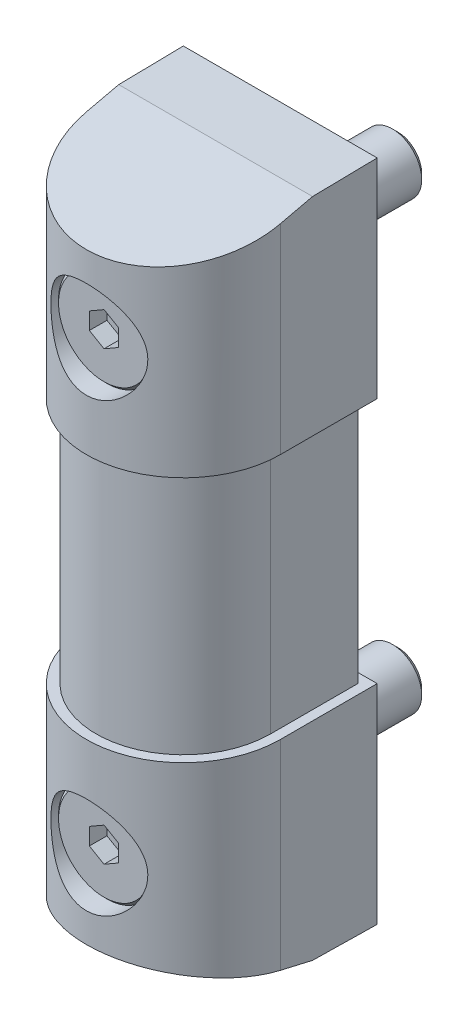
ISO-10303-21;
HEADER;
FILE_DESCRIPTION(('STEP AP214'),'2;1');
FILE_NAME('part.step','',(''),(''),'','','');
FILE_SCHEMA(('AUTOMOTIVE_DESIGN { 1 0 10303 214 1 1 1 1 }'));
ENDSEC;
DATA;
#1=APPLICATION_CONTEXT('core data for automotive mechanical design processes');
#2=APPLICATION_PROTOCOL_DEFINITION('international standard','automotive_design',2000,#1);
#3=PRODUCT_CONTEXT('',#1,'mechanical');
#4=PRODUCT('Part','Part','',(#3));
#5=PRODUCT_RELATED_PRODUCT_CATEGORY('part','',(#4));
#6=PRODUCT_DEFINITION_FORMATION('','',#4);
#7=PRODUCT_DEFINITION_CONTEXT('part definition',#1,'design');
#8=PRODUCT_DEFINITION('design','',#6,#7);
#9=PRODUCT_DEFINITION_SHAPE('','',#8);
#10=(LENGTH_UNIT() NAMED_UNIT(*) SI_UNIT(.MILLI.,.METRE.));
#11=(NAMED_UNIT(*) PLANE_ANGLE_UNIT() SI_UNIT($,.RADIAN.));
#12=(NAMED_UNIT(*) SI_UNIT($,.STERADIAN.) SOLID_ANGLE_UNIT());
#13=UNCERTAINTY_MEASURE_WITH_UNIT(LENGTH_MEASURE(1.E-05),#10,'distance_accuracy_value','');
#14=(GEOMETRIC_REPRESENTATION_CONTEXT(3) GLOBAL_UNCERTAINTY_ASSIGNED_CONTEXT((#13)) GLOBAL_UNIT_ASSIGNED_CONTEXT((#10,
#11,#12)) REPRESENTATION_CONTEXT('',''));
#15=CARTESIAN_POINT('',(0.,0.,0.));
#16=DIRECTION('',(0.,0.,1.));
#17=DIRECTION('',(1.,0.,0.));
#18=AXIS2_PLACEMENT_3D('',#15,#16,#17);
#19=CARTESIAN_POINT('',(0.,56.5,16.5));
#20=DIRECTION('',(0.,-1.,0.));
#21=DIRECTION('',(0.,0.,-1.));
#22=AXIS2_PLACEMENT_3D('',#19,#20,#21);
#23=CYLINDRICAL_SURFACE('',#22,16.5);
#24=CARTESIAN_POINT('',(0.,-55.038219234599,16.5));
#25=DIRECTION('',(0.,-0.974370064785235,0.224951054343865));
#26=DIRECTION('',(0.,-0.224951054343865,-0.974370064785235));
#27=AXIS2_PLACEMENT_3D('',#24,#25,#26);
#28=ELLIPSE('',#27,16.934017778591,16.5);
#29=CARTESIAN_POINT('',(16.5,-55.038219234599,16.5));
#30=VERTEX_POINT('',#29);
#31=CARTESIAN_POINT('',(-16.5,-55.038219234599,16.5));
#32=VERTEX_POINT('',#31);
#33=EDGE_CURVE('E323',#30,#32,#28,.T.);
#34=ORIENTED_EDGE('',*,*,#33,.F.);
#35=DIRECTION('',(0.,-1.,0.));
#36=VECTOR('',#35,1.);
#37=CARTESIAN_POINT('',(16.5,56.5,16.5));
#38=LINE('',#37,#36);
#39=CARTESIAN_POINT('',(16.5,-21.,16.5));
#40=VERTEX_POINT('',#39);
#41=EDGE_CURVE('E397',#40,#30,#38,.T.);
#42=ORIENTED_EDGE('',*,*,#41,.F.);
#43=CARTESIAN_POINT('',(0.,-21.,16.5));
#44=DIRECTION('',(0.,1.,0.));
#45=DIRECTION('',(0.,0.,1.));
#46=AXIS2_PLACEMENT_3D('',#43,#44,#45);
#47=CIRCLE('',#46,16.5);
#48=CARTESIAN_POINT('',(-16.5,-21.,16.5));
#49=VERTEX_POINT('',#48);
#50=EDGE_CURVE('E371',#49,#40,#47,.T.);
#51=ORIENTED_EDGE('',*,*,#50,.F.);
#52=DIRECTION('',(0.,-1.,0.));
#53=VECTOR('',#52,1.);
#54=CARTESIAN_POINT('',(-16.5,56.5,16.5));
#55=LINE('',#54,#53);
#56=EDGE_CURVE('E400',#49,#32,#55,.T.);
#57=ORIENTED_EDGE('',*,*,#56,.T.);
#58=EDGE_LOOP('',(#34,#42,#51,#57));
#59=FACE_BOUND('',#58,.T.);
#60=CARTESIAN_POINT('',(-8.25,-38.,30.7894191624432));
#61=CARTESIAN_POINT('',(-8.24999907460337,-38.2150470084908,30.78942039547));
#62=CARTESIAN_POINT('',(-8.24158057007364,-38.4301127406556,30.7942902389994));
#63=CARTESIAN_POINT('',(-8.20801678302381,-38.8585869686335,30.8135888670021));
#64=CARTESIAN_POINT('',(-8.18286371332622,-39.0719946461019,30.8280221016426));
#65=CARTESIAN_POINT('',(-8.11611532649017,-39.4957441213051,30.8659368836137));
#66=CARTESIAN_POINT('',(-8.07449422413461,-39.7060805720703,30.8894326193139));
#67=CARTESIAN_POINT('',(-7.9753111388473,-40.1219408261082,30.9446400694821));
#68=CARTESIAN_POINT('',(-7.917742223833,-40.3274624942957,30.9763553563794));
#69=CARTESIAN_POINT('',(-7.78768786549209,-40.7311407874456,31.046729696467));
#70=CARTESIAN_POINT('',(-7.71529072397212,-40.9293331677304,31.0853474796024));
#71=CARTESIAN_POINT('',(-7.55603013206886,-41.3186072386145,31.1684857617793));
#72=CARTESIAN_POINT('',(-7.46916143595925,-41.5096863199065,31.2130084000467));
#73=CARTESIAN_POINT('',(-7.28168497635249,-41.8837249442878,31.3066889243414));
#74=CARTESIAN_POINT('',(-7.18108045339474,-42.0666863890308,31.3558457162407));
#75=CARTESIAN_POINT('',(-6.96677985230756,-42.4237817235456,31.4575413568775));
#76=CARTESIAN_POINT('',(-6.853083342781,-42.5979153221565,31.5100803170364));
#77=CARTESIAN_POINT('',(-6.60332557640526,-42.9506632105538,31.6217164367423));
#78=CARTESIAN_POINT('',(-6.46619303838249,-43.1284617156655,31.680997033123));
#79=CARTESIAN_POINT('',(-6.17808014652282,-43.4721210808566,31.8005113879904));
#80=CARTESIAN_POINT('',(-6.02709915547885,-43.6379813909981,31.8607451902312));
#81=CARTESIAN_POINT('',(-5.71196603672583,-43.9570325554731,31.9806936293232));
#82=CARTESIAN_POINT('',(-5.54780852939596,-44.1102181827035,32.0404080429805));
#83=CARTESIAN_POINT('',(-5.20711423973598,-44.4030402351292,32.1578553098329));
#84=CARTESIAN_POINT('',(-5.03057558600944,-44.5426746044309,32.215587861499));
#85=CARTESIAN_POINT('',(-4.65359156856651,-44.8164847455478,32.3314733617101));
#86=CARTESIAN_POINT('',(-4.45233684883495,-44.949649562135,32.3893897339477));
#87=CARTESIAN_POINT('',(-4.03789661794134,-45.198351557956,32.4997296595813));
#88=CARTESIAN_POINT('',(-3.82471624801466,-45.3138962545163,32.5521555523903));
#89=CARTESIAN_POINT('',(-3.38774029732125,-45.5262678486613,32.6500255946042));
#90=CARTESIAN_POINT('',(-3.16394731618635,-45.6230993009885,32.6954714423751));
#91=CARTESIAN_POINT('',(-2.70731410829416,-45.7969619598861,32.7780298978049));
#92=CARTESIAN_POINT('',(-2.47447484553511,-45.8739952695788,32.8151433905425));
#93=CARTESIAN_POINT('',(-2.01845834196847,-46.0025237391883,32.877575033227));
#94=CARTESIAN_POINT('',(-1.79577204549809,-46.0554457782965,32.9035444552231));
#95=CARTESIAN_POINT('',(-1.34593235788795,-46.142692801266,32.9465650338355));
#96=CARTESIAN_POINT('',(-1.11877916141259,-46.1770185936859,32.9636165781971));
#97=CARTESIAN_POINT('',(-0.662008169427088,-46.2266028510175,32.9882998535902));
#98=CARTESIAN_POINT('',(-0.432391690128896,-46.2418710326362,32.9959363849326));
#99=CARTESIAN_POINT('',(0.027426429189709,-46.2531586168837,33.0015787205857));
#100=CARTESIAN_POINT('',(0.257628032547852,-46.2491791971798,32.9995851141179));
#101=CARTESIAN_POINT('',(0.696592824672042,-46.2232177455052,32.9866219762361));
#102=CARTESIAN_POINT('',(0.905476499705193,-46.2028343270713,32.9764495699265));
#103=CARTESIAN_POINT('',(1.32057888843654,-46.1463148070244,32.9483841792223));
#104=CARTESIAN_POINT('',(1.52679757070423,-46.110178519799,32.9304911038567));
#105=CARTESIAN_POINT('',(1.93515864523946,-46.0225478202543,32.8874134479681));
#106=CARTESIAN_POINT('',(2.13730107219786,-45.9710535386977,32.8622289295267));
#107=CARTESIAN_POINT('',(2.53624033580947,-45.8532319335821,32.8051555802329));
#108=CARTESIAN_POINT('',(2.73303698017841,-45.7869040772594,32.7732665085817));
#109=CARTESIAN_POINT('',(3.1227850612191,-45.6390272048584,32.7030226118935));
#110=CARTESIAN_POINT('',(3.31564788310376,-45.5572835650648,32.6645857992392));
#111=CARTESIAN_POINT('',(3.69371673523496,-45.3798784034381,32.5824110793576));
#112=CARTESIAN_POINT('',(3.87892019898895,-45.284212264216,32.5386714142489));
#113=CARTESIAN_POINT('',(4.42160346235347,-44.9774253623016,32.4008933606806));
#114=CARTESIAN_POINT('',(4.76638651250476,-44.746427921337,32.3002526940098));
#115=CARTESIAN_POINT('',(5.44653048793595,-44.2130419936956,32.0796356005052));
#116=CARTESIAN_POINT('',(5.77791998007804,-43.9059691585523,31.9587306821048));
#117=CARTESIAN_POINT('',(6.23417892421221,-43.4081733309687,31.7778256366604));
#118=CARTESIAN_POINT('',(6.37955355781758,-43.2359021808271,31.7175548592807));
#119=CARTESIAN_POINT('',(6.65602991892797,-42.8796088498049,31.5986712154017));
#120=CARTESIAN_POINT('',(6.78712948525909,-42.6955848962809,31.5400586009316));
#121=CARTESIAN_POINT('',(7.04209094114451,-42.3045746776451,31.4224636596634));
#122=CARTESIAN_POINT('',(7.16495580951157,-42.0968725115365,31.3636968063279));
#123=CARTESIAN_POINT('',(7.39250753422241,-41.6703831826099,31.2518440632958));
#124=CARTESIAN_POINT('',(7.49720257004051,-41.4516010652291,31.1987556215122));
#125=CARTESIAN_POINT('',(7.68736571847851,-41.004317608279,31.1002014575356));
#126=CARTESIAN_POINT('',(7.77284519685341,-40.7758221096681,31.0547312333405));
#127=CARTESIAN_POINT('',(7.92358966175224,-40.3106238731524,30.9732196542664));
#128=CARTESIAN_POINT('',(7.98885740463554,-40.07392225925,30.9371770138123));
#129=CARTESIAN_POINT('',(8.09389396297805,-39.6132835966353,30.8785328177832));
#130=CARTESIAN_POINT('',(8.13527284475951,-39.3898202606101,30.8550928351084));
#131=CARTESIAN_POINT('',(8.19949693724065,-38.939406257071,30.8185064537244));
#132=CARTESIAN_POINT('',(8.22234319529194,-38.7124557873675,30.8053594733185));
#133=CARTESIAN_POINT('',(8.24913970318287,-38.257209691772,30.7899242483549));
#134=CARTESIAN_POINT('',(8.25310136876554,-38.0289149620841,30.7876294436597));
#135=CARTESIAN_POINT('',(8.24209442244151,-37.5729445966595,30.7939820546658));
#136=CARTESIAN_POINT('',(8.2271270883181,-37.3452689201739,30.8026287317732));
#137=CARTESIAN_POINT('',(8.18117900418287,-36.9174600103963,30.8289535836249));
#138=CARTESIAN_POINT('',(8.15213632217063,-36.7170467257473,30.8455362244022));
#139=CARTESIAN_POINT('',(8.07957850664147,-36.3196048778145,30.8865265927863));
#140=CARTESIAN_POINT('',(8.03605858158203,-36.1225774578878,30.9109369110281));
#141=CARTESIAN_POINT('',(7.93502472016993,-35.7332099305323,30.9668140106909));
#142=CARTESIAN_POINT('',(7.87751265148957,-35.5408692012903,30.9982798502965));
#143=CARTESIAN_POINT('',(7.74901450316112,-35.1618060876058,31.067363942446));
#144=CARTESIAN_POINT('',(7.67802307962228,-34.9750859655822,31.1049846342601));
#145=CARTESIAN_POINT('',(7.5196050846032,-34.5997928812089,31.1872005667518));
#146=CARTESIAN_POINT('',(7.43157368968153,-34.4115282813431,31.2320366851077));
#147=CARTESIAN_POINT('',(7.24205925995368,-34.0429766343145,31.3261177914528));
#148=CARTESIAN_POINT('',(7.1405717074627,-33.8626922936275,31.3753642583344));
#149=CARTESIAN_POINT('',(6.92478169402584,-33.5108464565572,31.4770365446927));
#150=CARTESIAN_POINT('',(6.81047604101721,-33.3392871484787,31.5294631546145));
#151=CARTESIAN_POINT('',(6.56967743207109,-33.0055850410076,31.6362706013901));
#152=CARTESIAN_POINT('',(6.44318367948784,-32.8434428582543,31.6906515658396));
#153=CARTESIAN_POINT('',(6.16186397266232,-32.5093299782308,31.807104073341));
#154=CARTESIAN_POINT('',(6.00547763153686,-32.3387059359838,31.8692791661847));
#155=CARTESIAN_POINT('',(5.67884540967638,-32.0111183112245,31.9929403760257));
#156=CARTESIAN_POINT('',(5.50860327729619,-31.85415105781,32.0544266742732));
#157=CARTESIAN_POINT('',(5.15492168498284,-31.5546124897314,32.1751944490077));
#158=CARTESIAN_POINT('',(4.97147262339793,-31.4120518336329,32.2344742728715));
#159=CARTESIAN_POINT('',(4.59248386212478,-31.1424754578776,32.3492357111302));
#160=CARTESIAN_POINT('',(4.39694936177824,-31.0154531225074,32.4047189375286));
#161=CARTESIAN_POINT('',(3.98937189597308,-30.7747033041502,32.5118856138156));
#162=CARTESIAN_POINT('',(3.77702724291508,-30.6614223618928,32.5634277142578));
#163=CARTESIAN_POINT('',(3.34193295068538,-30.4533364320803,32.659551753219));
#164=CARTESIAN_POINT('',(3.11918296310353,-30.3585320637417,32.7041334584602));
#165=CARTESIAN_POINT('',(2.66503002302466,-30.1885432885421,32.7849859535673));
#166=CARTESIAN_POINT('',(2.43363338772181,-30.1133448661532,32.8212626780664));
#167=CARTESIAN_POINT('',(1.96390698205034,-29.983459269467,32.8844193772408));
#168=CARTESIAN_POINT('',(1.72557803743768,-29.9287696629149,32.9113004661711));
#169=CARTESIAN_POINT('',(1.26621412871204,-29.8447186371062,32.9528086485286));
#170=CARTESIAN_POINT('',(1.04559981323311,-29.8134930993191,32.9683340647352));
#171=CARTESIAN_POINT('',(0.602127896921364,-29.7689859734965,32.9905038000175));
#172=CARTESIAN_POINT('',(0.37927043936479,-29.7557032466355,32.9971486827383));
#173=CARTESIAN_POINT('',(-0.0668051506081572,-29.7472556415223,33.0013719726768));
#174=CARTESIAN_POINT('',(-0.290023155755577,-29.752085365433,32.9989530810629));
#175=CARTESIAN_POINT('',(-0.735051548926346,-29.7797871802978,32.9851221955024));
#176=CARTESIAN_POINT('',(-0.956861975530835,-29.8026587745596,32.9737104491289));
#177=CARTESIAN_POINT('',(-1.38270146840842,-29.8640421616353,32.9432556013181));
#178=CARTESIAN_POINT('',(-1.58693554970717,-29.9014182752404,32.9247677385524));
#179=CARTESIAN_POINT('',(-1.99134281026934,-29.9912565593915,32.8806574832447));
#180=CARTESIAN_POINT('',(-2.19151457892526,-30.0437238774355,32.8550326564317));
#181=CARTESIAN_POINT('',(-2.58642670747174,-30.1631992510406,32.7972456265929));
#182=CARTESIAN_POINT('',(-2.78116863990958,-30.2302030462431,32.765085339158));
#183=CARTESIAN_POINT('',(-3.16426072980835,-30.378180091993,32.6949188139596));
#184=CARTESIAN_POINT('',(-3.35260836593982,-30.4591587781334,32.6569103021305));
#185=CARTESIAN_POINT('',(-3.72970788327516,-30.6381276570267,32.5741439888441));
#186=CARTESIAN_POINT('',(-3.91813869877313,-30.7366932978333,32.529168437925));
#187=CARTESIAN_POINT('',(-4.28606011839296,-30.9475419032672,32.4347349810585));
#188=CARTESIAN_POINT('',(-4.46554764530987,-31.0598295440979,32.3852755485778));
#189=CARTESIAN_POINT('',(-4.81474987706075,-31.2973673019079,32.2829431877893));
#190=CARTESIAN_POINT('',(-4.98446261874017,-31.4226200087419,32.2300695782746));
#191=CARTESIAN_POINT('',(-5.31337610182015,-31.6853468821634,32.122035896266));
#192=CARTESIAN_POINT('',(-5.47257625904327,-31.8228217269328,32.0668756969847));
#193=CARTESIAN_POINT('',(-5.795155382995,-32.1236036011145,31.9498695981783));
#194=CARTESIAN_POINT('',(-5.95736644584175,-32.2881194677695,31.8879057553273));
#195=CARTESIAN_POINT('',(-6.26742808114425,-32.6301659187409,31.7642458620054));
#196=CARTESIAN_POINT('',(-6.41528262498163,-32.8076928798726,31.7025497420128));
#197=CARTESIAN_POINT('',(-6.69601303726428,-33.1751255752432,31.5810089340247));
#198=CARTESIAN_POINT('',(-6.82887383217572,-33.365043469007,31.5211661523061));
#199=CARTESIAN_POINT('',(-7.0786061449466,-33.7562178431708,31.4051099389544));
#200=CARTESIAN_POINT('',(-7.19547543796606,-33.9574758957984,31.3488970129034));
#201=CARTESIAN_POINT('',(-7.41576677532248,-34.3769089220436,31.2401485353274));
#202=CARTESIAN_POINT('',(-7.51863906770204,-34.5954191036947,31.1877881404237));
#203=CARTESIAN_POINT('',(-7.705269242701,-35.041985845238,31.0907469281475));
#204=CARTESIAN_POINT('',(-7.78903696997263,-35.2700374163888,31.046062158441));
#205=CARTESIAN_POINT('',(-7.93629460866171,-35.7335691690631,30.9662446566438));
#206=CARTESIAN_POINT('',(-7.99983668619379,-35.9690284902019,30.9310873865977));
#207=CARTESIAN_POINT('',(-8.10596741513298,-36.4458530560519,30.8717436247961));
#208=CARTESIAN_POINT('',(-8.14857071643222,-36.6872140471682,30.8475494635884));
#209=CARTESIAN_POINT('',(-8.20350797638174,-37.1073463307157,30.8161844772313));
#210=CARTESIAN_POINT('',(-8.22092583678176,-37.2852598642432,30.8061718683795));
#211=CARTESIAN_POINT('',(-8.24417262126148,-37.6421112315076,30.7927884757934));
#212=CARTESIAN_POINT('',(-8.25000077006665,-37.8210491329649,30.7894181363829));
#213=CARTESIAN_POINT('',(-8.25,-38.,30.7894191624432));
#214=B_SPLINE_CURVE_WITH_KNOTS('',3,(#60,#61,#62,#63,#64,#65,#66,#67,#68,#69,#70,#71,#72,#73,
#74,#75,#76,#77,#78,#79,#80,#81,#82,#83,#84,#85,#86,#87,#88,#89,#90,#91,#92,#93,#94,#95,#96,#97,
#98,#99,#100,#101,#102,#103,#104,#105,#106,#107,#108,#109,#110,#111,#112,#113,#114,#115,#116,
#117,#118,#119,#120,#121,#122,#123,#124,#125,#126,#127,#128,#129,#130,#131,#132,#133,#134,#135,
#136,#137,#138,#139,#140,#141,#142,#143,#144,#145,#146,#147,#148,#149,#150,#151,#152,#153,#154,
#155,#156,#157,#158,#159,#160,#161,#162,#163,#164,#165,#166,#167,#168,#169,#170,#171,#172,#173,
#174,#175,#176,#177,#178,#179,#180,#181,#182,#183,#184,#185,#186,#187,#188,#189,#190,#191,#192,
#193,#194,#195,#196,#197,#198,#199,#200,#201,#202,#203,#204,#205,#206,#207,#208,#209,#210,#211,
#212,#213),.UNSPECIFIED.,.T.,.F.,(4,2,2,2,2,2,2,2,2,2,2,2,2,2,2,2,2,2,2,2,2,2,2,2,2,2,2,2,2,2,2,
2,2,2,2,2,2,2,2,2,2,2,2,2,2,2,2,2,2,2,2,2,2,2,2,2,2,2,2,2,2,2,2,2,2,2,2,2,2,2,2,2,2,2,2,2,4),
(0.,0.644955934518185,1.2902121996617,1.93648281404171,2.58303478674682,3.22584300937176,
3.86888474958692,4.51177504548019,5.154686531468,5.85064470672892,6.54663492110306,
7.24291074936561,7.93929204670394,8.68285902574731,9.42610788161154,10.1691756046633,
10.912164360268,11.6022992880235,12.2924042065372,12.982157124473,13.6718678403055,
14.3014901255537,14.9311198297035,15.5607441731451,16.1903911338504,16.828595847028,
17.4670127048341,18.7431032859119,20.1398193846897,20.8392145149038,21.5387153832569,
22.2828918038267,23.0267323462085,23.7701317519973,24.5134297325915,25.1978608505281,
25.8822532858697,26.566231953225,27.250164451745,27.8590242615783,28.4680857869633,
29.0770660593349,29.6862882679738,30.3234747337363,30.9608756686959,31.5984356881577,
32.2360374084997,32.9542000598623,33.6721690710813,34.3906654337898,35.1088548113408,
35.8462561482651,36.5836821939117,37.320579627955,38.0573896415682,38.7265665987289,
39.3957010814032,40.0646361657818,40.7335528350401,41.3581849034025,41.9830302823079,
42.6076927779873,43.2325987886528,43.8839848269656,44.53559346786,45.187332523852,
45.8391077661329,46.555913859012,47.2725210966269,47.9898424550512,48.707263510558,
49.4476340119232,50.1876221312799,50.9256859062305,51.6632325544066,52.1998952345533,
52.7365938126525),.UNSPECIFIED.);
#215=CARTESIAN_POINT('',(-8.25,-38.,30.7894191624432));
#216=VERTEX_POINT('',#215);
#217=EDGE_CURVE('E9',#216,#216,#214,.T.);
#218=ORIENTED_EDGE('',*,*,#217,.F.);
#219=EDGE_LOOP('',(#218));
#220=FACE_BOUND('',#219,.T.);
#221=ADVANCED_FACE('F14',(#59,#220),#23,.T.);
#222=CARTESIAN_POINT('',(0.,55.038219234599,16.5));
#223=DIRECTION('',(0.,0.974370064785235,0.224951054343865));
#224=DIRECTION('',(0.,-0.224951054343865,0.974370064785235));
#225=AXIS2_PLACEMENT_3D('',#222,#223,#224);
#226=ELLIPSE('',#225,16.934017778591,16.5);
#227=CARTESIAN_POINT('',(-16.5,55.038219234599,16.5));
#228=VERTEX_POINT('',#227);
#229=CARTESIAN_POINT('',(16.5,55.038219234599,16.5));
#230=VERTEX_POINT('',#229);
#231=EDGE_CURVE('E333',#228,#230,#226,.T.);
#232=ORIENTED_EDGE('',*,*,#231,.F.);
#233=CARTESIAN_POINT('',(-16.5,21.,16.5));
#234=VERTEX_POINT('',#233);
#235=EDGE_CURVE('E401',#228,#234,#55,.T.);
#236=ORIENTED_EDGE('',*,*,#235,.T.);
#237=CARTESIAN_POINT('',(0.,21.,16.5));
#238=DIRECTION('',(0.,1.,0.));
#239=DIRECTION('',(0.,0.,1.));
#240=AXIS2_PLACEMENT_3D('',#237,#238,#239);
#241=CIRCLE('',#240,16.5);
#242=CARTESIAN_POINT('',(16.5,21.,16.5));
#243=VERTEX_POINT('',#242);
#244=EDGE_CURVE('E378',#234,#243,#241,.T.);
#245=ORIENTED_EDGE('',*,*,#244,.T.);
#246=EDGE_CURVE('E398',#230,#243,#38,.T.);
#247=ORIENTED_EDGE('',*,*,#246,.F.);
#248=EDGE_LOOP('',(#232,#236,#245,#247));
#249=FACE_BOUND('',#248,.T.);
#250=CARTESIAN_POINT('',(-8.25,38.,30.7894191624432));
#251=CARTESIAN_POINT('',(-8.24999907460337,37.7849529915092,30.78942039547));
#252=CARTESIAN_POINT('',(-8.24158057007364,37.5698872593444,30.7942902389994));
#253=CARTESIAN_POINT('',(-8.20801678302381,37.1414130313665,30.8135888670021));
#254=CARTESIAN_POINT('',(-8.18286371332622,36.9280053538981,30.8280221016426));
#255=CARTESIAN_POINT('',(-8.11611532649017,36.5042558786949,30.8659368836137));
#256=CARTESIAN_POINT('',(-8.07449422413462,36.2939194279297,30.8894326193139));
#257=CARTESIAN_POINT('',(-7.9753111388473,35.8780591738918,30.9446400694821));
#258=CARTESIAN_POINT('',(-7.917742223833,35.6725375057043,30.9763553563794));
#259=CARTESIAN_POINT('',(-7.78768786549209,35.2688592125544,31.046729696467));
#260=CARTESIAN_POINT('',(-7.71529072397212,35.0706668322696,31.0853474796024));
#261=CARTESIAN_POINT('',(-7.55603013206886,34.6813927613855,31.1684857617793));
#262=CARTESIAN_POINT('',(-7.46916143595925,34.4903136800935,31.2130084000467));
#263=CARTESIAN_POINT('',(-7.2816849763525,34.1162750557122,31.3066889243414));
#264=CARTESIAN_POINT('',(-7.18108045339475,33.9333136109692,31.3558457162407));
#265=CARTESIAN_POINT('',(-6.96677985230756,33.5762182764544,31.4575413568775));
#266=CARTESIAN_POINT('',(-6.853083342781,33.4020846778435,31.5100803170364));
#267=CARTESIAN_POINT('',(-6.60332557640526,33.0493367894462,31.6217164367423));
#268=CARTESIAN_POINT('',(-6.46619303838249,32.8715382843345,31.680997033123));
#269=CARTESIAN_POINT('',(-6.17808014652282,32.5278789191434,31.8005113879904));
#270=CARTESIAN_POINT('',(-6.02709915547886,32.3620186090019,31.8607451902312));
#271=CARTESIAN_POINT('',(-5.71196603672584,32.0429674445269,31.9806936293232));
#272=CARTESIAN_POINT('',(-5.54780852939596,31.8897818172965,32.0404080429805));
#273=CARTESIAN_POINT('',(-5.20711423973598,31.5969597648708,32.1578553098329));
#274=CARTESIAN_POINT('',(-5.03057558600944,31.4573253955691,32.215587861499));
#275=CARTESIAN_POINT('',(-4.65359156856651,31.1835152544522,32.3314733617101));
#276=CARTESIAN_POINT('',(-4.45233684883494,31.050350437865,32.3893897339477));
#277=CARTESIAN_POINT('',(-4.03789661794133,30.801648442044,32.4997296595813));
#278=CARTESIAN_POINT('',(-3.82471624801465,30.6861037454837,32.5521555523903));
#279=CARTESIAN_POINT('',(-3.38774029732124,30.4737321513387,32.6500255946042));
#280=CARTESIAN_POINT('',(-3.16394731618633,30.3769006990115,32.6954714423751));
#281=CARTESIAN_POINT('',(-2.70731410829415,30.2030380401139,32.7780298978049));
#282=CARTESIAN_POINT('',(-2.47447484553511,30.1260047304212,32.8151433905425));
#283=CARTESIAN_POINT('',(-2.01845834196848,29.9974762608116,32.877575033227));
#284=CARTESIAN_POINT('',(-1.79577204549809,29.9445542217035,32.9035444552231));
#285=CARTESIAN_POINT('',(-1.34593235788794,29.857307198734,32.9465650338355));
#286=CARTESIAN_POINT('',(-1.11877916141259,29.8229814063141,32.9636165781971));
#287=CARTESIAN_POINT('',(-0.662008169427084,29.7733971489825,32.9882998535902));
#288=CARTESIAN_POINT('',(-0.432391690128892,29.7581289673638,32.9959363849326));
#289=CARTESIAN_POINT('',(0.0274264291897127,29.7468413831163,33.0015787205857));
#290=CARTESIAN_POINT('',(0.257628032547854,29.7508208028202,32.9995851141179));
#291=CARTESIAN_POINT('',(0.696592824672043,29.7767822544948,32.9866219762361));
#292=CARTESIAN_POINT('',(0.905476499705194,29.7971656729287,32.9764495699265));
#293=CARTESIAN_POINT('',(1.32057888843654,29.8536851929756,32.9483841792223));
#294=CARTESIAN_POINT('',(1.52679757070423,29.889821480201,32.9304911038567));
#295=CARTESIAN_POINT('',(1.93515864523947,29.9774521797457,32.8874134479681));
#296=CARTESIAN_POINT('',(2.13730107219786,30.0289464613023,32.8622289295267));
#297=CARTESIAN_POINT('',(2.53624033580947,30.1467680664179,32.8051555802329));
#298=CARTESIAN_POINT('',(2.73303698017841,30.2130959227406,32.7732665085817));
#299=CARTESIAN_POINT('',(3.1227850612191,30.3609727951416,32.7030226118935));
#300=CARTESIAN_POINT('',(3.31564788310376,30.4427164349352,32.6645857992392));
#301=CARTESIAN_POINT('',(3.69371673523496,30.6201215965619,32.5824110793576));
#302=CARTESIAN_POINT('',(3.87892019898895,30.715787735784,32.5386714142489));
#303=CARTESIAN_POINT('',(4.42160346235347,31.0225746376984,32.4008933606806));
#304=CARTESIAN_POINT('',(4.76638651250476,31.253572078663,32.3002526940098));
#305=CARTESIAN_POINT('',(5.44653048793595,31.7869580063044,32.0796356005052));
#306=CARTESIAN_POINT('',(5.77791998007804,32.0940308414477,31.9587306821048));
#307=CARTESIAN_POINT('',(6.23417892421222,32.5918266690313,31.7778256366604));
#308=CARTESIAN_POINT('',(6.37955355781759,32.7640978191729,31.7175548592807));
#309=CARTESIAN_POINT('',(6.65602991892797,33.1203911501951,31.5986712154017));
#310=CARTESIAN_POINT('',(6.78712948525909,33.3044151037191,31.5400586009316));
#311=CARTESIAN_POINT('',(7.04209094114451,33.6954253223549,31.4224636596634));
#312=CARTESIAN_POINT('',(7.16495580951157,33.9031274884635,31.3636968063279));
#313=CARTESIAN_POINT('',(7.39250753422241,34.3296168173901,31.2518440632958));
#314=CARTESIAN_POINT('',(7.49720257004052,34.5483989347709,31.1987556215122));
#315=CARTESIAN_POINT('',(7.68736571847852,34.995682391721,31.1002014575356));
#316=CARTESIAN_POINT('',(7.77284519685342,35.2241778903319,31.0547312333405));
#317=CARTESIAN_POINT('',(7.92358966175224,35.6893761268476,30.9732196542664));
#318=CARTESIAN_POINT('',(7.98885740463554,35.9260777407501,30.9371770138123));
#319=CARTESIAN_POINT('',(8.09389396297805,36.3867164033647,30.8785328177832));
#320=CARTESIAN_POINT('',(8.13527284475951,36.6101797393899,30.8550928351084));
#321=CARTESIAN_POINT('',(8.19949693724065,37.060593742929,30.8185064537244));
#322=CARTESIAN_POINT('',(8.22234319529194,37.2875442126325,30.8053594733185));
#323=CARTESIAN_POINT('',(8.24913970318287,37.742790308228,30.7899242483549));
#324=CARTESIAN_POINT('',(8.25310136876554,37.971085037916,30.7876294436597));
#325=CARTESIAN_POINT('',(8.24209442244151,38.4270554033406,30.7939820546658));
#326=CARTESIAN_POINT('',(8.2271270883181,38.6547310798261,30.8026287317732));
#327=CARTESIAN_POINT('',(8.18117900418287,39.0825399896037,30.8289535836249));
#328=CARTESIAN_POINT('',(8.15213632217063,39.2829532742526,30.8455362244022));
#329=CARTESIAN_POINT('',(8.07957850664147,39.6803951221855,30.8865265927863));
#330=CARTESIAN_POINT('',(8.03605858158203,39.8774225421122,30.9109369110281));
#331=CARTESIAN_POINT('',(7.93502472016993,40.2667900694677,30.9668140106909));
#332=CARTESIAN_POINT('',(7.87751265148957,40.4591307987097,30.9982798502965));
#333=CARTESIAN_POINT('',(7.74901450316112,40.8381939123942,31.067363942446));
#334=CARTESIAN_POINT('',(7.67802307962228,41.0249140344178,31.1049846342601));
#335=CARTESIAN_POINT('',(7.5196050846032,41.4002071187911,31.1872005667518));
#336=CARTESIAN_POINT('',(7.43157368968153,41.5884717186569,31.2320366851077));
#337=CARTESIAN_POINT('',(7.24205925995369,41.9570233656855,31.3261177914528));
#338=CARTESIAN_POINT('',(7.1405717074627,42.1373077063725,31.3753642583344));
#339=CARTESIAN_POINT('',(6.92478169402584,42.4891535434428,31.4770365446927));
#340=CARTESIAN_POINT('',(6.81047604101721,42.6607128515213,31.5294631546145));
#341=CARTESIAN_POINT('',(6.56967743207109,42.9944149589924,31.6362706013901));
#342=CARTESIAN_POINT('',(6.44318367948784,43.1565571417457,31.6906515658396));
#343=CARTESIAN_POINT('',(6.16186397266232,43.4906700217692,31.807104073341));
#344=CARTESIAN_POINT('',(6.00547763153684,43.6612940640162,31.8692791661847));
#345=CARTESIAN_POINT('',(5.67884540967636,43.9888816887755,31.9929403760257));
#346=CARTESIAN_POINT('',(5.50860327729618,44.14584894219,32.0544266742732));
#347=CARTESIAN_POINT('',(5.15492168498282,44.4453875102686,32.1751944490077));
#348=CARTESIAN_POINT('',(4.97147262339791,44.5879481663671,32.2344742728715));
#349=CARTESIAN_POINT('',(4.59248386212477,44.8575245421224,32.3492357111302));
#350=CARTESIAN_POINT('',(4.39694936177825,44.9845468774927,32.4047189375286));
#351=CARTESIAN_POINT('',(3.98937189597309,45.2252966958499,32.5118856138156));
#352=CARTESIAN_POINT('',(3.77702724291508,45.3385776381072,32.5634277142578));
#353=CARTESIAN_POINT('',(3.34193295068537,45.5466635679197,32.659551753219));
#354=CARTESIAN_POINT('',(3.11918296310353,45.6414679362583,32.7041334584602));
#355=CARTESIAN_POINT('',(2.66503002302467,45.8114567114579,32.7849859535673));
#356=CARTESIAN_POINT('',(2.43363338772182,45.8866551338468,32.8212626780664));
#357=CARTESIAN_POINT('',(1.96390698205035,46.016540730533,32.8844193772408));
#358=CARTESIAN_POINT('',(1.72557803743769,46.071230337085,32.9113004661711));
#359=CARTESIAN_POINT('',(1.26621412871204,46.1552813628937,32.9528086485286));
#360=CARTESIAN_POINT('',(1.04559981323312,46.1865069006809,32.9683340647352));
#361=CARTESIAN_POINT('',(0.602127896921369,46.2310140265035,32.9905038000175));
#362=CARTESIAN_POINT('',(0.379270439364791,46.2442967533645,32.9971486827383));
#363=CARTESIAN_POINT('',(-0.0668051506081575,46.2527443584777,33.0013719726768));
#364=CARTESIAN_POINT('',(-0.290023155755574,46.247914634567,32.9989530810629));
#365=CARTESIAN_POINT('',(-0.735051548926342,46.2202128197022,32.9851221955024));
#366=CARTESIAN_POINT('',(-0.956861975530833,46.1973412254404,32.9737104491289));
#367=CARTESIAN_POINT('',(-1.38270146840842,46.1359578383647,32.9432556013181));
#368=CARTESIAN_POINT('',(-1.58693554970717,46.0985817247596,32.9247677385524));
#369=CARTESIAN_POINT('',(-1.99134281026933,46.0087434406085,32.8806574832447));
#370=CARTESIAN_POINT('',(-2.19151457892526,45.9562761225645,32.8550326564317));
#371=CARTESIAN_POINT('',(-2.58642670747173,45.8368007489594,32.7972456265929));
#372=CARTESIAN_POINT('',(-2.78116863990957,45.7697969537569,32.765085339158));
#373=CARTESIAN_POINT('',(-3.16426072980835,45.621819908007,32.6949188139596));
#374=CARTESIAN_POINT('',(-3.35260836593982,45.5408412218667,32.6569103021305));
#375=CARTESIAN_POINT('',(-3.72970788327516,45.3618723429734,32.5741439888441));
#376=CARTESIAN_POINT('',(-3.91813869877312,45.2633067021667,32.529168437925));
#377=CARTESIAN_POINT('',(-4.28606011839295,45.0524580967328,32.4347349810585));
#378=CARTESIAN_POINT('',(-4.46554764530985,44.9401704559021,32.3852755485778));
#379=CARTESIAN_POINT('',(-4.81474987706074,44.7026326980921,32.2829431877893));
#380=CARTESIAN_POINT('',(-4.98446261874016,44.5773799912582,32.2300695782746));
#381=CARTESIAN_POINT('',(-5.31337610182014,44.3146531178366,32.122035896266));
#382=CARTESIAN_POINT('',(-5.47257625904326,44.1771782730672,32.0668756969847));
#383=CARTESIAN_POINT('',(-5.795155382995,43.8763963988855,31.9498695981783));
#384=CARTESIAN_POINT('',(-5.95736644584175,43.7118805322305,31.8879057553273));
#385=CARTESIAN_POINT('',(-6.26742808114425,43.3698340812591,31.7642458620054));
#386=CARTESIAN_POINT('',(-6.41528262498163,43.1923071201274,31.7025497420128));
#387=CARTESIAN_POINT('',(-6.69601303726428,42.8248744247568,31.5810089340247));
#388=CARTESIAN_POINT('',(-6.82887383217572,42.634956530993,31.5211661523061));
#389=CARTESIAN_POINT('',(-7.0786061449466,42.2437821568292,31.4051099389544));
#390=CARTESIAN_POINT('',(-7.19547543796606,42.0425241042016,31.3488970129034));
#391=CARTESIAN_POINT('',(-7.41576677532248,41.6230910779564,31.2401485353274));
#392=CARTESIAN_POINT('',(-7.51863906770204,41.4045808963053,31.1877881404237));
#393=CARTESIAN_POINT('',(-7.70526924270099,40.9580141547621,31.0907469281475));
#394=CARTESIAN_POINT('',(-7.78903696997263,40.7299625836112,31.046062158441));
#395=CARTESIAN_POINT('',(-7.93629460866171,40.2664308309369,30.9662446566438));
#396=CARTESIAN_POINT('',(-7.99983668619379,40.0309715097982,30.9310873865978));
#397=CARTESIAN_POINT('',(-8.10596741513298,39.5541469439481,30.8717436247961));
#398=CARTESIAN_POINT('',(-8.14857071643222,39.3127859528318,30.8475494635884));
#399=CARTESIAN_POINT('',(-8.20350797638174,38.8926536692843,30.8161844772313));
#400=CARTESIAN_POINT('',(-8.22092583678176,38.7147401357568,30.8061718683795));
#401=CARTESIAN_POINT('',(-8.24417262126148,38.3578887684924,30.7927884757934));
#402=CARTESIAN_POINT('',(-8.25000077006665,38.1789508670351,30.7894181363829));
#403=CARTESIAN_POINT('',(-8.25,38.,30.7894191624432));
#404=B_SPLINE_CURVE_WITH_KNOTS('',3,(#250,#251,#252,#253,#254,#255,#256,#257,#258,#259,#260,
#261,#262,#263,#264,#265,#266,#267,#268,#269,#270,#271,#272,#273,#274,#275,#276,#277,#278,#279,
#280,#281,#282,#283,#284,#285,#286,#287,#288,#289,#290,#291,#292,#293,#294,#295,#296,#297,#298,
#299,#300,#301,#302,#303,#304,#305,#306,#307,#308,#309,#310,#311,#312,#313,#314,#315,#316,#317,
#318,#319,#320,#321,#322,#323,#324,#325,#326,#327,#328,#329,#330,#331,#332,#333,#334,#335,#336,
#337,#338,#339,#340,#341,#342,#343,#344,#345,#346,#347,#348,#349,#350,#351,#352,#353,#354,#355,
#356,#357,#358,#359,#360,#361,#362,#363,#364,#365,#366,#367,#368,#369,#370,#371,#372,#373,#374,
#375,#376,#377,#378,#379,#380,#381,#382,#383,#384,#385,#386,#387,#388,#389,#390,#391,#392,#393,
#394,#395,#396,#397,#398,#399,#400,#401,#402,#403),.UNSPECIFIED.,.T.,.F.,(4,2,2,2,2,2,2,2,2,2,2,
2,2,2,2,2,2,2,2,2,2,2,2,2,2,2,2,2,2,2,2,2,2,2,2,2,2,2,2,2,2,2,2,2,2,2,2,2,2,2,2,2,2,2,2,2,2,2,2,
2,2,2,2,2,2,2,2,2,2,2,2,2,2,2,2,2,4),(0.,0.644955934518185,1.29021219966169,1.9364828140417,
2.58303478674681,3.22584300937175,3.86888474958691,4.51177504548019,5.15468653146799,
5.85064470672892,6.54663492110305,7.24291074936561,7.93929204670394,8.68285902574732,
9.42610788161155,10.1691756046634,10.912164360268,11.6022992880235,12.2924042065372,
12.982157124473,13.6718678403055,14.3014901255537,14.9311198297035,15.5607441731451,
16.1903911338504,16.828595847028,17.4670127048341,18.7431032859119,20.1398193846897,
20.8392145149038,21.5387153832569,22.2828918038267,23.0267323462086,23.7701317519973,
24.5134297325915,25.1978608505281,25.8822532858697,26.566231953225,27.250164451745,
27.8590242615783,28.4680857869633,29.0770660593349,29.6862882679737,30.3234747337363,
30.9608756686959,31.5984356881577,32.2360374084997,32.9542000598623,33.6721690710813,
34.3906654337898,35.1088548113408,35.8462561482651,36.5836821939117,37.3205796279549,
38.0573896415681,38.7265665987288,39.3957010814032,40.0646361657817,40.7335528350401,
41.3581849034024,41.9830302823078,42.6076927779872,43.2325987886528,43.8839848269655,
44.5355934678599,45.187332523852,45.8391077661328,46.555913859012,47.2725210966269,
47.9898424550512,48.7072635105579,49.4476340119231,50.1876221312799,50.9256859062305,
51.6632325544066,52.1998952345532,52.7365938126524),.UNSPECIFIED.);
#405=CARTESIAN_POINT('',(-8.25,38.,30.7894191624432));
#406=VERTEX_POINT('',#405);
#407=EDGE_CURVE('E26',#406,#406,#404,.T.);
#408=ORIENTED_EDGE('',*,*,#407,.F.);
#409=EDGE_LOOP('',(#408));
#410=FACE_BOUND('',#409,.T.);
#411=ADVANCED_FACE('F424',(#249,#410),#23,.T.);
#412=CARTESIAN_POINT('',(-16.5,56.5,0.));
#413=DIRECTION('',(1.,0.,0.));
#414=DIRECTION('',(0.,0.,-1.));
#415=AXIS2_PLACEMENT_3D('',#412,#413,#414);
#416=PLANE('',#415);
#417=DIRECTION('',(0.,-0.224951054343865,0.974370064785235));
#418=VECTOR('',#417,1.);
#419=CARTESIAN_POINT('',(-16.5,58.7287516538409,0.514547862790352));
#420=LINE('',#419,#418);
#421=CARTESIAN_POINT('',(-16.5,56.3079942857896,11.));
#422=VERTEX_POINT('',#421);
#423=EDGE_CURVE('E335',#422,#228,#420,.T.);
#424=ORIENTED_EDGE('',*,*,#423,.F.);
#425=DIRECTION('',(0.,-0.0174524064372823,0.999847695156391));
#426=VECTOR('',#425,1.);
#427=CARTESIAN_POINT('',(-16.5,56.5,0.));
#428=LINE('',#427,#426);
#429=CARTESIAN_POINT('',(-16.5,56.5,0.));
#430=VERTEX_POINT('',#429);
#431=EDGE_CURVE('E331',#430,#422,#428,.T.);
#432=ORIENTED_EDGE('',*,*,#431,.F.);
#433=DIRECTION('',(0.,-1.,0.));
#434=VECTOR('',#433,1.);
#435=CARTESIAN_POINT('',(-16.5,56.5,0.));
#436=LINE('',#435,#434);
#437=CARTESIAN_POINT('',(-16.5,21.,0.));
#438=VERTEX_POINT('',#437);
#439=EDGE_CURVE('E390',#430,#438,#436,.T.);
#440=ORIENTED_EDGE('',*,*,#439,.T.);
#441=DIRECTION('',(0.,0.,1.));
#442=VECTOR('',#441,1.);
#443=CARTESIAN_POINT('',(-16.5,21.,0.));
#444=LINE('',#443,#442);
#445=EDGE_CURVE('E381',#438,#234,#444,.T.);
#446=ORIENTED_EDGE('',*,*,#445,.T.);
#447=ORIENTED_EDGE('',*,*,#235,.F.);
#448=EDGE_LOOP('',(#424,#432,#440,#446,#447));
#449=FACE_BOUND('',#448,.T.);
#450=ADVANCED_FACE('F16',(#449),#416,.F.);
#451=CARTESIAN_POINT('',(16.5,56.5,16.5));
#452=DIRECTION('',(-1.,0.,0.));
#453=DIRECTION('',(0.,0.,1.));
#454=AXIS2_PLACEMENT_3D('',#451,#452,#453);
#455=PLANE('',#454);
#456=DIRECTION('',(0.,0.224951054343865,-0.974370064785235));
#457=VECTOR('',#456,1.);
#458=CARTESIAN_POINT('',(16.5,55.112189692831,16.1795987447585));
#459=LINE('',#458,#457);
#460=CARTESIAN_POINT('',(16.5,56.3079942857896,11.));
#461=VERTEX_POINT('',#460);
#462=EDGE_CURVE('E412',#230,#461,#459,.T.);
#463=ORIENTED_EDGE('',*,*,#462,.F.);
#464=ORIENTED_EDGE('',*,*,#246,.T.);
#465=DIRECTION('',(0.,0.,-1.));
#466=VECTOR('',#465,1.);
#467=CARTESIAN_POINT('',(16.5,21.,16.5));
#468=LINE('',#467,#466);
#469=CARTESIAN_POINT('',(16.5,21.,0.));
#470=VERTEX_POINT('',#469);
#471=EDGE_CURVE('E375',#243,#470,#468,.T.);
#472=ORIENTED_EDGE('',*,*,#471,.T.);
#473=DIRECTION('',(0.,-1.,0.));
#474=VECTOR('',#473,1.);
#475=CARTESIAN_POINT('',(16.5,56.5,0.));
#476=LINE('',#475,#474);
#477=CARTESIAN_POINT('',(16.5,56.5,0.));
#478=VERTEX_POINT('',#477);
#479=EDGE_CURVE('E394',#478,#470,#476,.T.);
#480=ORIENTED_EDGE('',*,*,#479,.F.);
#481=DIRECTION('',(0.,0.0174524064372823,-0.999847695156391));
#482=VECTOR('',#481,1.);
#483=CARTESIAN_POINT('',(16.5,56.2120791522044,16.4949743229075));
#484=LINE('',#483,#482);
#485=EDGE_CURVE('E329',#461,#478,#484,.T.);
#486=ORIENTED_EDGE('',*,*,#485,.F.);
#487=EDGE_LOOP('',(#463,#464,#472,#480,#486));
#488=FACE_BOUND('',#487,.T.);
#489=ADVANCED_FACE('F504',(#488),#455,.F.);
#490=DIRECTION('',(0.,0.0174524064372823,0.999847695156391));
#491=VECTOR('',#490,1.);
#492=CARTESIAN_POINT('',(16.5,-56.1776608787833,18.4667958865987));
#493=LINE('',#492,#491);
#494=CARTESIAN_POINT('',(16.5,-56.5,0.));
#495=VERTEX_POINT('',#494);
#496=CARTESIAN_POINT('',(16.5,-56.3079942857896,11.));
#497=VERTEX_POINT('',#496);
#498=EDGE_CURVE('E327',#495,#497,#493,.T.);
#499=ORIENTED_EDGE('',*,*,#498,.F.);
#500=CARTESIAN_POINT('',(16.5,-21.,0.));
#501=VERTEX_POINT('',#500);
#502=EDGE_CURVE('E393',#501,#495,#476,.T.);
#503=ORIENTED_EDGE('',*,*,#502,.F.);
#504=DIRECTION('',(0.,0.,-1.));
#505=VECTOR('',#504,1.);
#506=CARTESIAN_POINT('',(16.5,-21.,16.5));
#507=LINE('',#506,#505);
#508=EDGE_CURVE('E364',#40,#501,#507,.T.);
#509=ORIENTED_EDGE('',*,*,#508,.F.);
#510=ORIENTED_EDGE('',*,*,#41,.T.);
#511=DIRECTION('',(0.,0.224951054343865,0.974370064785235));
#512=VECTOR('',#511,1.);
#513=CARTESIAN_POINT('',(16.5,-49.3940533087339,40.9475685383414));
#514=LINE('',#513,#512);
#515=EDGE_CURVE('E325',#497,#30,#514,.T.);
#516=ORIENTED_EDGE('',*,*,#515,.F.);
#517=EDGE_LOOP('',(#499,#503,#509,#510,#516));
#518=FACE_BOUND('',#517,.T.);
#519=ADVANCED_FACE('F506',(#518),#455,.F.);
#520=DIRECTION('',(0.,-0.0174524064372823,-0.999847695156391));
#521=VECTOR('',#520,1.);
#522=CARTESIAN_POINT('',(-16.5,-56.4655817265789,1.97182156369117));
#523=LINE('',#522,#521);
#524=CARTESIAN_POINT('',(-16.5,-56.3079942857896,11.));
#525=VERTEX_POINT('',#524);
#526=CARTESIAN_POINT('',(-16.5,-56.5,0.));
#527=VERTEX_POINT('',#526);
#528=EDGE_CURVE('E410',#525,#527,#523,.T.);
#529=ORIENTED_EDGE('',*,*,#528,.F.);
#530=DIRECTION('',(0.,-0.224951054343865,-0.974370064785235));
#531=VECTOR('',#530,1.);
#532=CARTESIAN_POINT('',(-16.5,-53.0106152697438,25.2825176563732));
#533=LINE('',#532,#531);
#534=EDGE_CURVE('E408',#32,#525,#533,.T.);
#535=ORIENTED_EDGE('',*,*,#534,.F.);
#536=ORIENTED_EDGE('',*,*,#56,.F.);
#537=DIRECTION('',(0.,0.,1.));
#538=VECTOR('',#537,1.);
#539=CARTESIAN_POINT('',(-16.5,-21.,0.));
#540=LINE('',#539,#538);
#541=CARTESIAN_POINT('',(-16.5,-21.,0.));
#542=VERTEX_POINT('',#541);
#543=EDGE_CURVE('E373',#542,#49,#540,.T.);
#544=ORIENTED_EDGE('',*,*,#543,.F.);
#545=EDGE_CURVE('E387',#542,#527,#436,.T.);
#546=ORIENTED_EDGE('',*,*,#545,.T.);
#547=EDGE_LOOP('',(#529,#535,#536,#544,#546));
#548=FACE_BOUND('',#547,.T.);
#549=ADVANCED_FACE('F502',(#548),#416,.F.);
#550=CARTESIAN_POINT('',(16.5,56.5,0.));
#551=DIRECTION('',(0.,0.,1.));
#552=DIRECTION('',(1.,0.,0.));
#553=AXIS2_PLACEMENT_3D('',#550,#551,#552);
#554=PLANE('',#553);
#555=CARTESIAN_POINT('',(0.,38.,0.));
#556=DIRECTION('',(0.,0.,1.));
#557=DIRECTION('',(1.,0.,0.));
#558=AXIS2_PLACEMENT_3D('',#555,#556,#557);
#559=CIRCLE('',#558,5.);
#560=CARTESIAN_POINT('',(5.,38.,0.));
#561=VERTEX_POINT('',#560);
#562=EDGE_CURVE('E414',#561,#561,#559,.F.);
#563=ORIENTED_EDGE('',*,*,#562,.F.);
#564=EDGE_LOOP('',(#563));
#565=FACE_BOUND('',#564,.T.);
#566=ORIENTED_EDGE('',*,*,#479,.T.);
#567=DIRECTION('',(-1.,0.,0.));
#568=VECTOR('',#567,1.);
#569=CARTESIAN_POINT('',(16.5,21.,0.));
#570=LINE('',#569,#568);
#571=EDGE_CURVE('E405',#470,#438,#570,.T.);
#572=ORIENTED_EDGE('',*,*,#571,.T.);
#573=ORIENTED_EDGE('',*,*,#439,.F.);
#574=DIRECTION('',(-1.,0.,0.));
#575=VECTOR('',#574,1.);
#576=CARTESIAN_POINT('',(16.5,56.5,0.));
#577=LINE('',#576,#575);
#578=EDGE_CURVE('E385',#478,#430,#577,.T.);
#579=ORIENTED_EDGE('',*,*,#578,.F.);
#580=EDGE_LOOP('',(#566,#572,#573,#579));
#581=FACE_BOUND('',#580,.T.);
#582=ADVANCED_FACE('F480',(#565,#581),#554,.F.);
#583=CARTESIAN_POINT('',(0.,21.,0.));
#584=DIRECTION('',(0.,1.,0.));
#585=DIRECTION('',(0.,0.,1.));
#586=AXIS2_PLACEMENT_3D('',#583,#584,#585);
#587=PLANE('',#586);
#588=DIRECTION('',(0.,0.,1.));
#589=VECTOR('',#588,1.);
#590=CARTESIAN_POINT('',(-14.85,21.,1.65));
#591=LINE('',#590,#589);
#592=CARTESIAN_POINT('',(-14.85,21.,1.65));
#593=VERTEX_POINT('',#592);
#594=CARTESIAN_POINT('',(-14.85,21.,16.5));
#595=VERTEX_POINT('',#594);
#596=EDGE_CURVE('E348',#593,#595,#591,.T.);
#597=ORIENTED_EDGE('',*,*,#596,.T.);
#598=CARTESIAN_POINT('',(0.,21.,16.5));
#599=DIRECTION('',(0.,1.,0.));
#600=DIRECTION('',(1.,0.,0.));
#601=AXIS2_PLACEMENT_3D('',#598,#599,#600);
#602=CIRCLE('',#601,14.85);
#603=CARTESIAN_POINT('',(14.85,21.,16.5));
#604=VERTEX_POINT('',#603);
#605=EDGE_CURVE('E338',#595,#604,#602,.T.);
#606=ORIENTED_EDGE('',*,*,#605,.T.);
#607=DIRECTION('',(0.,0.,-1.));
#608=VECTOR('',#607,1.);
#609=CARTESIAN_POINT('',(14.85,21.,16.5));
#610=LINE('',#609,#608);
#611=CARTESIAN_POINT('',(14.85,21.,1.65));
#612=VERTEX_POINT('',#611);
#613=EDGE_CURVE('E341',#604,#612,#610,.T.);
#614=ORIENTED_EDGE('',*,*,#613,.T.);
#615=DIRECTION('',(-1.,0.,0.));
#616=VECTOR('',#615,1.);
#617=CARTESIAN_POINT('',(14.85,21.,1.65));
#618=LINE('',#617,#616);
#619=EDGE_CURVE('E345',#612,#593,#618,.T.);
#620=ORIENTED_EDGE('',*,*,#619,.T.);
#621=EDGE_LOOP('',(#597,#606,#614,#620));
#622=FACE_BOUND('',#621,.T.);
#623=ORIENTED_EDGE('',*,*,#571,.F.);
#624=ORIENTED_EDGE('',*,*,#471,.F.);
#625=ORIENTED_EDGE('',*,*,#244,.F.);
#626=ORIENTED_EDGE('',*,*,#445,.F.);
#627=EDGE_LOOP('',(#623,#624,#625,#626));
#628=FACE_BOUND('',#627,.T.);
#629=ADVANCED_FACE('F476',(#622,#628),#587,.F.);
#630=CARTESIAN_POINT('',(0.,-21.,0.));
#631=DIRECTION('',(0.,1.,0.));
#632=DIRECTION('',(0.,0.,1.));
#633=AXIS2_PLACEMENT_3D('',#630,#631,#632);
#634=PLANE('',#633);
#635=DIRECTION('',(0.,0.,1.));
#636=VECTOR('',#635,1.);
#637=CARTESIAN_POINT('',(-14.85,-21.,1.65));
#638=LINE('',#637,#636);
#639=CARTESIAN_POINT('',(-14.85,-21.,1.65));
#640=VERTEX_POINT('',#639);
#641=CARTESIAN_POINT('',(-14.85,-21.,16.5));
#642=VERTEX_POINT('',#641);
#643=EDGE_CURVE('E342',#640,#642,#638,.T.);
#644=ORIENTED_EDGE('',*,*,#643,.F.);
#645=DIRECTION('',(-1.,0.,0.));
#646=VECTOR('',#645,1.);
#647=CARTESIAN_POINT('',(14.85,-21.,1.65));
#648=LINE('',#647,#646);
#649=CARTESIAN_POINT('',(14.85,-21.,1.65));
#650=VERTEX_POINT('',#649);
#651=EDGE_CURVE('E357',#650,#640,#648,.T.);
#652=ORIENTED_EDGE('',*,*,#651,.F.);
#653=DIRECTION('',(0.,0.,-1.));
#654=VECTOR('',#653,1.);
#655=CARTESIAN_POINT('',(14.85,-21.,16.5));
#656=LINE('',#655,#654);
#657=CARTESIAN_POINT('',(14.85,-21.,16.5));
#658=VERTEX_POINT('',#657);
#659=EDGE_CURVE('E354',#658,#650,#656,.T.);
#660=ORIENTED_EDGE('',*,*,#659,.F.);
#661=CARTESIAN_POINT('',(0.,-21.,16.5));
#662=DIRECTION('',(0.,1.,0.));
#663=DIRECTION('',(1.,0.,0.));
#664=AXIS2_PLACEMENT_3D('',#661,#662,#663);
#665=CIRCLE('',#664,14.85);
#666=EDGE_CURVE('E337',#642,#658,#665,.T.);
#667=ORIENTED_EDGE('',*,*,#666,.F.);
#668=EDGE_LOOP('',(#644,#652,#660,#667));
#669=FACE_BOUND('',#668,.T.);
#670=ORIENTED_EDGE('',*,*,#543,.T.);
#671=ORIENTED_EDGE('',*,*,#50,.T.);
#672=ORIENTED_EDGE('',*,*,#508,.T.);
#673=DIRECTION('',(-1.,0.,0.));
#674=VECTOR('',#673,1.);
#675=CARTESIAN_POINT('',(16.5,-21.,0.));
#676=LINE('',#675,#674);
#677=EDGE_CURVE('E403',#501,#542,#676,.T.);
#678=ORIENTED_EDGE('',*,*,#677,.T.);
#679=EDGE_LOOP('',(#670,#671,#672,#678));
#680=FACE_BOUND('',#679,.T.);
#681=ADVANCED_FACE('F479',(#669,#680),#634,.T.);
#682=CARTESIAN_POINT('',(-14.85,21.,1.65));
#683=DIRECTION('',(1.,0.,0.));
#684=DIRECTION('',(0.,0.,-1.));
#685=AXIS2_PLACEMENT_3D('',#682,#683,#684);
#686=PLANE('',#685);
#687=ORIENTED_EDGE('',*,*,#643,.T.);
#688=DIRECTION('',(0.,-1.,0.));
#689=VECTOR('',#688,1.);
#690=CARTESIAN_POINT('',(-14.85,21.,16.5));
#691=LINE('',#690,#689);
#692=EDGE_CURVE('E351',#595,#642,#691,.T.);
#693=ORIENTED_EDGE('',*,*,#692,.F.);
#694=ORIENTED_EDGE('',*,*,#596,.F.);
#695=DIRECTION('',(0.,-1.,0.));
#696=VECTOR('',#695,1.);
#697=CARTESIAN_POINT('',(-14.85,21.,1.65));
#698=LINE('',#697,#696);
#699=EDGE_CURVE('E362',#593,#640,#698,.T.);
#700=ORIENTED_EDGE('',*,*,#699,.T.);
#701=EDGE_LOOP('',(#687,#693,#694,#700));
#702=FACE_BOUND('',#701,.T.);
#703=ADVANCED_FACE('F484',(#702),#686,.F.);
#704=CARTESIAN_POINT('',(14.85,21.,1.65));
#705=DIRECTION('',(0.,0.,1.));
#706=DIRECTION('',(1.,0.,0.));
#707=AXIS2_PLACEMENT_3D('',#704,#705,#706);
#708=PLANE('',#707);
#709=ORIENTED_EDGE('',*,*,#651,.T.);
#710=ORIENTED_EDGE('',*,*,#699,.F.);
#711=ORIENTED_EDGE('',*,*,#619,.F.);
#712=DIRECTION('',(0.,-1.,0.));
#713=VECTOR('',#712,1.);
#714=CARTESIAN_POINT('',(14.85,21.,1.65));
#715=LINE('',#714,#713);
#716=EDGE_CURVE('E365',#612,#650,#715,.T.);
#717=ORIENTED_EDGE('',*,*,#716,.T.);
#718=EDGE_LOOP('',(#709,#710,#711,#717));
#719=FACE_BOUND('',#718,.T.);
#720=ADVANCED_FACE('F488',(#719),#708,.F.);
#721=CARTESIAN_POINT('',(14.85,21.,16.5));
#722=DIRECTION('',(-1.,0.,0.));
#723=DIRECTION('',(0.,0.,1.));
#724=AXIS2_PLACEMENT_3D('',#721,#722,#723);
#725=PLANE('',#724);
#726=ORIENTED_EDGE('',*,*,#659,.T.);
#727=ORIENTED_EDGE('',*,*,#716,.F.);
#728=ORIENTED_EDGE('',*,*,#613,.F.);
#729=DIRECTION('',(0.,-1.,0.));
#730=VECTOR('',#729,1.);
#731=CARTESIAN_POINT('',(14.85,21.,16.5));
#732=LINE('',#731,#730);
#733=EDGE_CURVE('E367',#604,#658,#732,.T.);
#734=ORIENTED_EDGE('',*,*,#733,.T.);
#735=EDGE_LOOP('',(#726,#727,#728,#734));
#736=FACE_BOUND('',#735,.T.);
#737=ADVANCED_FACE('F492',(#736),#725,.F.);
#738=CARTESIAN_POINT('',(0.,21.,16.5));
#739=DIRECTION('',(0.,-1.,0.));
#740=DIRECTION('',(0.,0.,-1.));
#741=AXIS2_PLACEMENT_3D('',#738,#739,#740);
#742=CYLINDRICAL_SURFACE('',#741,14.85);
#743=ORIENTED_EDGE('',*,*,#666,.T.);
#744=ORIENTED_EDGE('',*,*,#733,.F.);
#745=ORIENTED_EDGE('',*,*,#605,.F.);
#746=ORIENTED_EDGE('',*,*,#692,.T.);
#747=EDGE_LOOP('',(#743,#744,#745,#746));
#748=FACE_BOUND('',#747,.T.);
#749=ADVANCED_FACE('F496',(#748),#742,.T.);
#750=CARTESIAN_POINT('',(0.,-38.,0.));
#751=DIRECTION('',(0.,0.,1.));
#752=DIRECTION('',(1.,0.,0.));
#753=AXIS2_PLACEMENT_3D('',#750,#751,#752);
#754=CIRCLE('',#753,5.);
#755=CARTESIAN_POINT('',(5.,-38.,0.));
#756=VERTEX_POINT('',#755);
#757=EDGE_CURVE('E417',#756,#756,#754,.F.);
#758=ORIENTED_EDGE('',*,*,#757,.F.);
#759=EDGE_LOOP('',(#758));
#760=FACE_BOUND('',#759,.T.);
#761=ORIENTED_EDGE('',*,*,#677,.F.);
#762=ORIENTED_EDGE('',*,*,#502,.T.);
#763=DIRECTION('',(-1.,0.,0.));
#764=VECTOR('',#763,1.);
#765=CARTESIAN_POINT('',(16.5,-56.5,0.));
#766=LINE('',#765,#764);
#767=EDGE_CURVE('E384',#495,#527,#766,.T.);
#768=ORIENTED_EDGE('',*,*,#767,.T.);
#769=ORIENTED_EDGE('',*,*,#545,.F.);
#770=EDGE_LOOP('',(#761,#762,#768,#769));
#771=FACE_BOUND('',#770,.T.);
#772=ADVANCED_FACE('F471',(#760,#771),#554,.F.);
#773=CARTESIAN_POINT('',(33.,-56.3079942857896,11.));
#774=DIRECTION('',(0.,-0.974370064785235,0.224951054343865));
#775=DIRECTION('',(0.,-0.224951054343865,-0.974370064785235));
#776=AXIS2_PLACEMENT_3D('',#773,#774,#775);
#777=PLANE('',#776);
#778=ORIENTED_EDGE('',*,*,#515,.T.);
#779=ORIENTED_EDGE('',*,*,#33,.T.);
#780=ORIENTED_EDGE('',*,*,#534,.T.);
#781=DIRECTION('',(-1.,0.,0.));
#782=VECTOR('',#781,1.);
#783=CARTESIAN_POINT('',(33.,-56.3079942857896,11.));
#784=LINE('',#783,#782);
#785=EDGE_CURVE('E320',#497,#525,#784,.T.);
#786=ORIENTED_EDGE('',*,*,#785,.F.);
#787=EDGE_LOOP('',(#778,#779,#780,#786));
#788=FACE_BOUND('',#787,.T.);
#789=ADVANCED_FACE('F468',(#788),#777,.T.);
#790=CARTESIAN_POINT('',(33.,-56.5,0.));
#791=DIRECTION('',(0.,-0.999847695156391,0.0174524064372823));
#792=DIRECTION('',(0.,-0.0174524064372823,-0.999847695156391));
#793=AXIS2_PLACEMENT_3D('',#790,#791,#792);
#794=PLANE('',#793);
#795=ORIENTED_EDGE('',*,*,#498,.T.);
#796=ORIENTED_EDGE('',*,*,#785,.T.);
#797=ORIENTED_EDGE('',*,*,#528,.T.);
#798=ORIENTED_EDGE('',*,*,#767,.F.);
#799=EDGE_LOOP('',(#795,#796,#797,#798));
#800=FACE_BOUND('',#799,.T.);
#801=ADVANCED_FACE('F466',(#800),#794,.T.);
#802=CARTESIAN_POINT('',(33.,48.689343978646,44.));
#803=DIRECTION('',(0.,0.974370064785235,0.224951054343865));
#804=DIRECTION('',(0.,-0.224951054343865,0.974370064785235));
#805=AXIS2_PLACEMENT_3D('',#802,#803,#804);
#806=PLANE('',#805);
#807=ORIENTED_EDGE('',*,*,#423,.T.);
#808=ORIENTED_EDGE('',*,*,#231,.T.);
#809=ORIENTED_EDGE('',*,*,#462,.T.);
#810=DIRECTION('',(-1.,0.,0.));
#811=VECTOR('',#810,1.);
#812=CARTESIAN_POINT('',(33.,56.3079942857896,11.));
#813=LINE('',#812,#811);
#814=EDGE_CURVE('E317',#461,#422,#813,.T.);
#815=ORIENTED_EDGE('',*,*,#814,.T.);
#816=EDGE_LOOP('',(#807,#808,#809,#815));
#817=FACE_BOUND('',#816,.T.);
#818=ADVANCED_FACE('F462',(#817),#806,.T.);
#819=CARTESIAN_POINT('',(33.,56.3079942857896,11.));
#820=DIRECTION('',(0.,0.999847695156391,0.0174524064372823));
#821=DIRECTION('',(0.,-0.0174524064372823,0.999847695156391));
#822=AXIS2_PLACEMENT_3D('',#819,#820,#821);
#823=PLANE('',#822);
#824=ORIENTED_EDGE('',*,*,#431,.T.);
#825=ORIENTED_EDGE('',*,*,#814,.F.);
#826=ORIENTED_EDGE('',*,*,#485,.T.);
#827=ORIENTED_EDGE('',*,*,#578,.T.);
#828=EDGE_LOOP('',(#824,#825,#826,#827));
#829=FACE_BOUND('',#828,.T.);
#830=ADVANCED_FACE('F433',(#829),#823,.T.);
#831=CARTESIAN_POINT('',(0.,38.,30.));
#832=DIRECTION('',(0.,0.,-1.));
#833=DIRECTION('',(-1.,0.,0.));
#834=AXIS2_PLACEMENT_3D('',#831,#832,#833);
#835=CYLINDRICAL_SURFACE('',#834,8.25);
#836=CARTESIAN_POINT('',(0.,38.,29.5));
#837=DIRECTION('',(0.,0.,-1.));
#838=DIRECTION('',(-1.,0.,0.));
#839=AXIS2_PLACEMENT_3D('',#836,#837,#838);
#840=CIRCLE('',#839,8.25);
#841=CARTESIAN_POINT('',(-8.25,38.,29.5));
#842=VERTEX_POINT('',#841);
#843=EDGE_CURVE('E302',#842,#842,#840,.T.);
#844=ORIENTED_EDGE('',*,*,#843,.T.);
#845=EDGE_LOOP('',(#844));
#846=FACE_BOUND('',#845,.T.);
#847=ORIENTED_EDGE('',*,*,#407,.T.);
#848=EDGE_LOOP('',(#847));
#849=FACE_BOUND('',#848,.T.);
#850=ADVANCED_FACE('F427',(#846,#849),#835,.F.);
#851=CARTESIAN_POINT('',(0.,38.,29.5));
#852=DIRECTION('',(0.,0.,-1.));
#853=DIRECTION('',(-1.,0.,0.));
#854=AXIS2_PLACEMENT_3D('',#851,#852,#853);
#855=CONICAL_SURFACE('',#854,8.25,0.785398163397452);
#856=CARTESIAN_POINT('',(0.,38.,30.));
#857=DIRECTION('',(0.,0.,-1.));
#858=DIRECTION('',(-1.,0.,0.));
#859=AXIS2_PLACEMENT_3D('',#856,#857,#858);
#860=CIRCLE('',#859,7.75);
#861=CARTESIAN_POINT('',(-7.75,38.,30.));
#862=VERTEX_POINT('',#861);
#863=EDGE_CURVE('E299',#862,#862,#860,.T.);
#864=ORIENTED_EDGE('',*,*,#863,.T.);
#865=EDGE_LOOP('',(#864));
#866=FACE_BOUND('',#865,.T.);
#867=ORIENTED_EDGE('',*,*,#843,.F.);
#868=EDGE_LOOP('',(#867));
#869=FACE_BOUND('',#868,.T.);
#870=ADVANCED_FACE('F432',(#866,#869),#855,.T.);
#871=CARTESIAN_POINT('',(0.,45.75,30.));
#872=DIRECTION('',(0.,0.,1.));
#873=DIRECTION('',(1.,0.,0.));
#874=AXIS2_PLACEMENT_3D('',#871,#872,#873);
#875=PLANE('',#874);
#876=DIRECTION('',(-0.866025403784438,-0.5,0.));
#877=VECTOR('',#876,1.);
#878=CARTESIAN_POINT('',(0.,40.8867513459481,30.));
#879=LINE('',#878,#877);
#880=CARTESIAN_POINT('',(0.,40.8867513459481,30.));
#881=VERTEX_POINT('',#880);
#882=CARTESIAN_POINT('',(-2.5,39.443375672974,30.));
#883=VERTEX_POINT('',#882);
#884=EDGE_CURVE('E252',#881,#883,#879,.T.);
#885=ORIENTED_EDGE('',*,*,#884,.F.);
#886=DIRECTION('',(-0.866025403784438,0.5,0.));
#887=VECTOR('',#886,1.);
#888=CARTESIAN_POINT('',(2.5,39.443375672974,30.));
#889=LINE('',#888,#887);
#890=CARTESIAN_POINT('',(2.5,39.443375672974,30.));
#891=VERTEX_POINT('',#890);
#892=EDGE_CURVE('E41',#891,#881,#889,.T.);
#893=ORIENTED_EDGE('',*,*,#892,.F.);
#894=DIRECTION('',(0.,1.,0.));
#895=VECTOR('',#894,1.);
#896=CARTESIAN_POINT('',(2.5,36.556624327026,30.));
#897=LINE('',#896,#895);
#898=CARTESIAN_POINT('',(2.5,36.556624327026,30.));
#899=VERTEX_POINT('',#898);
#900=EDGE_CURVE('E276',#899,#891,#897,.T.);
#901=ORIENTED_EDGE('',*,*,#900,.F.);
#902=DIRECTION('',(0.866025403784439,0.5,0.));
#903=VECTOR('',#902,1.);
#904=CARTESIAN_POINT('',(0.,35.1132486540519,30.));
#905=LINE('',#904,#903);
#906=CARTESIAN_POINT('',(0.,35.1132486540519,30.));
#907=VERTEX_POINT('',#906);
#908=EDGE_CURVE('E273',#907,#899,#905,.T.);
#909=ORIENTED_EDGE('',*,*,#908,.F.);
#910=DIRECTION('',(0.866025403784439,-0.5,0.));
#911=VECTOR('',#910,1.);
#912=CARTESIAN_POINT('',(-2.5,36.556624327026,30.));
#913=LINE('',#912,#911);
#914=CARTESIAN_POINT('',(-2.5,36.556624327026,30.));
#915=VERTEX_POINT('',#914);
#916=EDGE_CURVE('E270',#915,#907,#913,.T.);
#917=ORIENTED_EDGE('',*,*,#916,.F.);
#918=DIRECTION('',(0.,-1.,0.));
#919=VECTOR('',#918,1.);
#920=CARTESIAN_POINT('',(-2.5,39.443375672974,30.));
#921=LINE('',#920,#919);
#922=EDGE_CURVE('E201',#883,#915,#921,.T.);
#923=ORIENTED_EDGE('',*,*,#922,.F.);
#924=EDGE_LOOP('',(#885,#893,#901,#909,#917,#923));
#925=FACE_BOUND('',#924,.T.);
#926=ORIENTED_EDGE('',*,*,#863,.F.);
#927=EDGE_LOOP('',(#926));
#928=FACE_BOUND('',#927,.T.);
#929=ADVANCED_FACE('F534',(#925,#928),#875,.T.);
#930=CARTESIAN_POINT('',(0.,-38.,30.));
#931=DIRECTION('',(0.,0.,-1.));
#932=DIRECTION('',(-1.,0.,0.));
#933=AXIS2_PLACEMENT_3D('',#930,#931,#932);
#934=CYLINDRICAL_SURFACE('',#933,8.25);
#935=CARTESIAN_POINT('',(0.,-38.,29.5));
#936=DIRECTION('',(0.,0.,-1.));
#937=DIRECTION('',(-1.,0.,0.));
#938=AXIS2_PLACEMENT_3D('',#935,#936,#937);
#939=CIRCLE('',#938,8.25);
#940=CARTESIAN_POINT('',(-8.25,-38.,29.5));
#941=VERTEX_POINT('',#940);
#942=EDGE_CURVE('E296',#941,#941,#939,.T.);
#943=ORIENTED_EDGE('',*,*,#942,.T.);
#944=EDGE_LOOP('',(#943));
#945=FACE_BOUND('',#944,.T.);
#946=ORIENTED_EDGE('',*,*,#217,.T.);
#947=EDGE_LOOP('',(#946));
#948=FACE_BOUND('',#947,.T.);
#949=ADVANCED_FACE('F531',(#945,#948),#934,.F.);
#950=CARTESIAN_POINT('',(0.,-38.,29.5));
#951=DIRECTION('',(0.,0.,-1.));
#952=DIRECTION('',(-1.,0.,0.));
#953=AXIS2_PLACEMENT_3D('',#950,#951,#952);
#954=CONICAL_SURFACE('',#953,8.25,0.785398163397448);
#955=CARTESIAN_POINT('',(0.,-38.,30.));
#956=DIRECTION('',(0.,0.,-1.));
#957=DIRECTION('',(-1.,0.,0.));
#958=AXIS2_PLACEMENT_3D('',#955,#956,#957);
#959=CIRCLE('',#958,7.75);
#960=CARTESIAN_POINT('',(-7.75,-38.,30.));
#961=VERTEX_POINT('',#960);
#962=EDGE_CURVE('E293',#961,#961,#959,.T.);
#963=ORIENTED_EDGE('',*,*,#962,.T.);
#964=EDGE_LOOP('',(#963));
#965=FACE_BOUND('',#964,.T.);
#966=ORIENTED_EDGE('',*,*,#942,.F.);
#967=EDGE_LOOP('',(#966));
#968=FACE_BOUND('',#967,.T.);
#969=ADVANCED_FACE('F533',(#965,#968),#954,.T.);
#970=CARTESIAN_POINT('',(0.,-30.25,30.));
#971=DIRECTION('',(0.,0.,1.));
#972=DIRECTION('',(1.,0.,0.));
#973=AXIS2_PLACEMENT_3D('',#970,#971,#972);
#974=PLANE('',#973);
#975=DIRECTION('',(-0.866025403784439,-0.5,0.));
#976=VECTOR('',#975,1.);
#977=CARTESIAN_POINT('',(0.,-35.1132486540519,30.));
#978=LINE('',#977,#976);
#979=CARTESIAN_POINT('',(0.,-35.1132486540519,30.));
#980=VERTEX_POINT('',#979);
#981=CARTESIAN_POINT('',(-2.5,-36.556624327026,30.));
#982=VERTEX_POINT('',#981);
#983=EDGE_CURVE('E217',#980,#982,#978,.T.);
#984=ORIENTED_EDGE('',*,*,#983,.F.);
#985=DIRECTION('',(-0.866025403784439,0.5,0.));
#986=VECTOR('',#985,1.);
#987=CARTESIAN_POINT('',(2.5,-36.556624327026,30.));
#988=LINE('',#987,#986);
#989=CARTESIAN_POINT('',(2.5,-36.556624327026,30.));
#990=VERTEX_POINT('',#989);
#991=EDGE_CURVE('E33',#990,#980,#988,.T.);
#992=ORIENTED_EDGE('',*,*,#991,.F.);
#993=DIRECTION('',(0.,1.,0.));
#994=VECTOR('',#993,1.);
#995=CARTESIAN_POINT('',(2.5,-39.443375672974,30.));
#996=LINE('',#995,#994);
#997=CARTESIAN_POINT('',(2.5,-39.443375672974,30.));
#998=VERTEX_POINT('',#997);
#999=EDGE_CURVE('E236',#998,#990,#996,.T.);
#1000=ORIENTED_EDGE('',*,*,#999,.F.);
#1001=DIRECTION('',(0.866025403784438,0.5,0.));
#1002=VECTOR('',#1001,1.);
#1003=CARTESIAN_POINT('',(0.,-40.8867513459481,30.));
#1004=LINE('',#1003,#1002);
#1005=CARTESIAN_POINT('',(0.,-40.8867513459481,30.));
#1006=VERTEX_POINT('',#1005);
#1007=EDGE_CURVE('E233',#1006,#998,#1004,.T.);
#1008=ORIENTED_EDGE('',*,*,#1007,.F.);
#1009=DIRECTION('',(0.866025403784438,-0.5,0.));
#1010=VECTOR('',#1009,1.);
#1011=CARTESIAN_POINT('',(-2.5,-39.443375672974,30.));
#1012=LINE('',#1011,#1010);
#1013=CARTESIAN_POINT('',(-2.5,-39.443375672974,30.));
#1014=VERTEX_POINT('',#1013);
#1015=EDGE_CURVE('E231',#1014,#1006,#1012,.T.);
#1016=ORIENTED_EDGE('',*,*,#1015,.F.);
#1017=DIRECTION('',(0.,-1.,0.));
#1018=VECTOR('',#1017,1.);
#1019=CARTESIAN_POINT('',(-2.5,-36.556624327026,30.));
#1020=LINE('',#1019,#1018);
#1021=EDGE_CURVE('E197',#982,#1014,#1020,.T.);
#1022=ORIENTED_EDGE('',*,*,#1021,.F.);
#1023=EDGE_LOOP('',(#984,#992,#1000,#1008,#1016,#1022));
#1024=FACE_BOUND('',#1023,.T.);
#1025=ORIENTED_EDGE('',*,*,#962,.F.);
#1026=EDGE_LOOP('',(#1025));
#1027=FACE_BOUND('',#1026,.T.);
#1028=ADVANCED_FACE('F541',(#1024,#1027),#974,.T.);
#1029=CARTESIAN_POINT('',(-2.5,39.443375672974,27.));
#1030=DIRECTION('',(-1.,0.,0.));
#1031=DIRECTION('',(0.,0.,1.));
#1032=AXIS2_PLACEMENT_3D('',#1029,#1030,#1031);
#1033=PLANE('',#1032);
#1034=ORIENTED_EDGE('',*,*,#922,.T.);
#1035=DIRECTION('',(0.,0.,1.));
#1036=VECTOR('',#1035,1.);
#1037=CARTESIAN_POINT('',(-2.5,36.556624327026,27.));
#1038=LINE('',#1037,#1036);
#1039=CARTESIAN_POINT('',(-2.5,36.556624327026,27.));
#1040=VERTEX_POINT('',#1039);
#1041=EDGE_CURVE('E291',#1040,#915,#1038,.T.);
#1042=ORIENTED_EDGE('',*,*,#1041,.F.);
#1043=DIRECTION('',(0.,-1.,0.));
#1044=VECTOR('',#1043,1.);
#1045=CARTESIAN_POINT('',(-2.5,39.443375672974,27.));
#1046=LINE('',#1045,#1044);
#1047=CARTESIAN_POINT('',(-2.5,39.443375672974,27.));
#1048=VERTEX_POINT('',#1047);
#1049=EDGE_CURVE('E248',#1048,#1040,#1046,.T.);
#1050=ORIENTED_EDGE('',*,*,#1049,.F.);
#1051=DIRECTION('',(0.,0.,1.));
#1052=VECTOR('',#1051,1.);
#1053=CARTESIAN_POINT('',(-2.5,39.443375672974,27.));
#1054=LINE('',#1053,#1052);
#1055=EDGE_CURVE('E267',#1048,#883,#1054,.T.);
#1056=ORIENTED_EDGE('',*,*,#1055,.T.);
#1057=EDGE_LOOP('',(#1034,#1042,#1050,#1056));
#1058=FACE_BOUND('',#1057,.T.);
#1059=ADVANCED_FACE('F549',(#1058),#1033,.F.);
#1060=CARTESIAN_POINT('',(-2.5,36.556624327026,27.));
#1061=DIRECTION('',(-0.5,-0.866025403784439,0.));
#1062=DIRECTION('',(0.866025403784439,-0.5,0.));
#1063=AXIS2_PLACEMENT_3D('',#1060,#1061,#1062);
#1064=PLANE('',#1063);
#1065=ORIENTED_EDGE('',*,*,#916,.T.);
#1066=DIRECTION('',(0.,0.,1.));
#1067=VECTOR('',#1066,1.);
#1068=CARTESIAN_POINT('',(0.,35.1132486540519,27.));
#1069=LINE('',#1068,#1067);
#1070=CARTESIAN_POINT('',(0.,35.1132486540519,27.));
#1071=VERTEX_POINT('',#1070);
#1072=EDGE_CURVE('E289',#1071,#907,#1069,.T.);
#1073=ORIENTED_EDGE('',*,*,#1072,.F.);
#1074=DIRECTION('',(0.866025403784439,-0.5,0.));
#1075=VECTOR('',#1074,1.);
#1076=CARTESIAN_POINT('',(-2.5,36.556624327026,27.));
#1077=LINE('',#1076,#1075);
#1078=EDGE_CURVE('E251',#1040,#1071,#1077,.T.);
#1079=ORIENTED_EDGE('',*,*,#1078,.F.);
#1080=ORIENTED_EDGE('',*,*,#1041,.T.);
#1081=EDGE_LOOP('',(#1065,#1073,#1079,#1080));
#1082=FACE_BOUND('',#1081,.T.);
#1083=ADVANCED_FACE('F553',(#1082),#1064,.F.);
#1084=CARTESIAN_POINT('',(0.,35.1132486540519,27.));
#1085=DIRECTION('',(0.5,-0.866025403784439,0.));
#1086=DIRECTION('',(0.866025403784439,0.5,0.));
#1087=AXIS2_PLACEMENT_3D('',#1084,#1085,#1086);
#1088=PLANE('',#1087);
#1089=ORIENTED_EDGE('',*,*,#908,.T.);
#1090=DIRECTION('',(0.,0.,1.));
#1091=VECTOR('',#1090,1.);
#1092=CARTESIAN_POINT('',(2.5,36.556624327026,27.));
#1093=LINE('',#1092,#1091);
#1094=CARTESIAN_POINT('',(2.5,36.556624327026,27.));
#1095=VERTEX_POINT('',#1094);
#1096=EDGE_CURVE('E287',#1095,#899,#1093,.T.);
#1097=ORIENTED_EDGE('',*,*,#1096,.F.);
#1098=DIRECTION('',(0.866025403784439,0.5,0.));
#1099=VECTOR('',#1098,1.);
#1100=CARTESIAN_POINT('',(0.,35.1132486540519,27.));
#1101=LINE('',#1100,#1099);
#1102=EDGE_CURVE('E255',#1071,#1095,#1101,.T.);
#1103=ORIENTED_EDGE('',*,*,#1102,.F.);
#1104=ORIENTED_EDGE('',*,*,#1072,.T.);
#1105=EDGE_LOOP('',(#1089,#1097,#1103,#1104));
#1106=FACE_BOUND('',#1105,.T.);
#1107=ADVANCED_FACE('F557',(#1106),#1088,.F.);
#1108=CARTESIAN_POINT('',(2.5,36.556624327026,27.));
#1109=DIRECTION('',(1.,0.,0.));
#1110=DIRECTION('',(0.,0.,-1.));
#1111=AXIS2_PLACEMENT_3D('',#1108,#1109,#1110);
#1112=PLANE('',#1111);
#1113=ORIENTED_EDGE('',*,*,#900,.T.);
#1114=DIRECTION('',(0.,0.,1.));
#1115=VECTOR('',#1114,1.);
#1116=CARTESIAN_POINT('',(2.5,39.443375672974,27.));
#1117=LINE('',#1116,#1115);
#1118=CARTESIAN_POINT('',(2.5,39.443375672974,27.));
#1119=VERTEX_POINT('',#1118);
#1120=EDGE_CURVE('E285',#1119,#891,#1117,.T.);
#1121=ORIENTED_EDGE('',*,*,#1120,.F.);
#1122=DIRECTION('',(0.,1.,0.));
#1123=VECTOR('',#1122,1.);
#1124=CARTESIAN_POINT('',(2.5,36.556624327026,27.));
#1125=LINE('',#1124,#1123);
#1126=EDGE_CURVE('E258',#1095,#1119,#1125,.T.);
#1127=ORIENTED_EDGE('',*,*,#1126,.F.);
#1128=ORIENTED_EDGE('',*,*,#1096,.T.);
#1129=EDGE_LOOP('',(#1113,#1121,#1127,#1128));
#1130=FACE_BOUND('',#1129,.T.);
#1131=ADVANCED_FACE('F561',(#1130),#1112,.F.);
#1132=CARTESIAN_POINT('',(2.5,39.443375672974,27.));
#1133=DIRECTION('',(0.5,0.866025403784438,0.));
#1134=DIRECTION('',(-0.866025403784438,0.5,0.));
#1135=AXIS2_PLACEMENT_3D('',#1132,#1133,#1134);
#1136=PLANE('',#1135);
#1137=ORIENTED_EDGE('',*,*,#892,.T.);
#1138=DIRECTION('',(0.,0.,1.));
#1139=VECTOR('',#1138,1.);
#1140=CARTESIAN_POINT('',(0.,40.8867513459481,27.));
#1141=LINE('',#1140,#1139);
#1142=CARTESIAN_POINT('',(0.,40.8867513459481,27.));
#1143=VERTEX_POINT('',#1142);
#1144=EDGE_CURVE('E283',#1143,#881,#1141,.T.);
#1145=ORIENTED_EDGE('',*,*,#1144,.F.);
#1146=DIRECTION('',(-0.866025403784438,0.5,0.));
#1147=VECTOR('',#1146,1.);
#1148=CARTESIAN_POINT('',(2.5,39.443375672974,27.));
#1149=LINE('',#1148,#1147);
#1150=EDGE_CURVE('E261',#1119,#1143,#1149,.T.);
#1151=ORIENTED_EDGE('',*,*,#1150,.F.);
#1152=ORIENTED_EDGE('',*,*,#1120,.T.);
#1153=EDGE_LOOP('',(#1137,#1145,#1151,#1152));
#1154=FACE_BOUND('',#1153,.T.);
#1155=ADVANCED_FACE('F565',(#1154),#1136,.F.);
#1156=CARTESIAN_POINT('',(0.,40.8867513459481,27.));
#1157=DIRECTION('',(-0.5,0.866025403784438,0.));
#1158=DIRECTION('',(-0.866025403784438,-0.5,0.));
#1159=AXIS2_PLACEMENT_3D('',#1156,#1157,#1158);
#1160=PLANE('',#1159);
#1161=ORIENTED_EDGE('',*,*,#884,.T.);
#1162=ORIENTED_EDGE('',*,*,#1055,.F.);
#1163=DIRECTION('',(-0.866025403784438,-0.5,0.));
#1164=VECTOR('',#1163,1.);
#1165=CARTESIAN_POINT('',(0.,40.8867513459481,27.));
#1166=LINE('',#1165,#1164);
#1167=EDGE_CURVE('E264',#1143,#1048,#1166,.T.);
#1168=ORIENTED_EDGE('',*,*,#1167,.F.);
#1169=ORIENTED_EDGE('',*,*,#1144,.T.);
#1170=EDGE_LOOP('',(#1161,#1162,#1168,#1169));
#1171=FACE_BOUND('',#1170,.T.);
#1172=ADVANCED_FACE('F569',(#1171),#1160,.F.);
#1173=CARTESIAN_POINT('',(0.,0.,27.));
#1174=DIRECTION('',(0.,0.,1.));
#1175=DIRECTION('',(1.,0.,0.));
#1176=AXIS2_PLACEMENT_3D('',#1173,#1174,#1175);
#1177=PLANE('',#1176);
#1178=ORIENTED_EDGE('',*,*,#1049,.T.);
#1179=ORIENTED_EDGE('',*,*,#1078,.T.);
#1180=ORIENTED_EDGE('',*,*,#1102,.T.);
#1181=ORIENTED_EDGE('',*,*,#1126,.T.);
#1182=ORIENTED_EDGE('',*,*,#1150,.T.);
#1183=ORIENTED_EDGE('',*,*,#1167,.T.);
#1184=EDGE_LOOP('',(#1178,#1179,#1180,#1181,#1182,#1183));
#1185=FACE_BOUND('',#1184,.T.);
#1186=ADVANCED_FACE('F572',(#1185),#1177,.T.);
#1187=CARTESIAN_POINT('',(-2.5,-36.556624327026,27.));
#1188=DIRECTION('',(-1.,0.,0.));
#1189=DIRECTION('',(0.,0.,1.));
#1190=AXIS2_PLACEMENT_3D('',#1187,#1188,#1189);
#1191=PLANE('',#1190);
#1192=ORIENTED_EDGE('',*,*,#1021,.T.);
#1193=DIRECTION('',(0.,0.,1.));
#1194=VECTOR('',#1193,1.);
#1195=CARTESIAN_POINT('',(-2.5,-39.443375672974,27.));
#1196=LINE('',#1195,#1194);
#1197=CARTESIAN_POINT('',(-2.5,-39.443375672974,27.));
#1198=VERTEX_POINT('',#1197);
#1199=EDGE_CURVE('E191',#1198,#1014,#1196,.T.);
#1200=ORIENTED_EDGE('',*,*,#1199,.F.);
#1201=DIRECTION('',(0.,-1.,0.));
#1202=VECTOR('',#1201,1.);
#1203=CARTESIAN_POINT('',(-2.5,-36.556624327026,27.));
#1204=LINE('',#1203,#1202);
#1205=CARTESIAN_POINT('',(-2.5,-36.556624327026,27.));
#1206=VERTEX_POINT('',#1205);
#1207=EDGE_CURVE('E195',#1206,#1198,#1204,.T.);
#1208=ORIENTED_EDGE('',*,*,#1207,.F.);
#1209=DIRECTION('',(0.,0.,1.));
#1210=VECTOR('',#1209,1.);
#1211=CARTESIAN_POINT('',(-2.5,-36.556624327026,27.));
#1212=LINE('',#1211,#1210);
#1213=EDGE_CURVE('E229',#1206,#982,#1212,.T.);
#1214=ORIENTED_EDGE('',*,*,#1213,.T.);
#1215=EDGE_LOOP('',(#1192,#1200,#1208,#1214));
#1216=FACE_BOUND('',#1215,.T.);
#1217=ADVANCED_FACE('F193',(#1216),#1191,.F.);
#1218=CARTESIAN_POINT('',(-2.5,-39.443375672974,27.));
#1219=DIRECTION('',(-0.5,-0.866025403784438,0.));
#1220=DIRECTION('',(0.866025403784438,-0.5,0.));
#1221=AXIS2_PLACEMENT_3D('',#1218,#1219,#1220);
#1222=PLANE('',#1221);
#1223=ORIENTED_EDGE('',*,*,#1015,.T.);
#1224=DIRECTION('',(0.,0.,1.));
#1225=VECTOR('',#1224,1.);
#1226=CARTESIAN_POINT('',(0.,-40.8867513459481,27.));
#1227=LINE('',#1226,#1225);
#1228=CARTESIAN_POINT('',(0.,-40.8867513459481,27.));
#1229=VERTEX_POINT('',#1228);
#1230=EDGE_CURVE('E202',#1229,#1006,#1227,.T.);
#1231=ORIENTED_EDGE('',*,*,#1230,.F.);
#1232=DIRECTION('',(0.866025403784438,-0.5,0.));
#1233=VECTOR('',#1232,1.);
#1234=CARTESIAN_POINT('',(-2.5,-39.443375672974,27.));
#1235=LINE('',#1234,#1233);
#1236=EDGE_CURVE('E205',#1198,#1229,#1235,.T.);
#1237=ORIENTED_EDGE('',*,*,#1236,.F.);
#1238=ORIENTED_EDGE('',*,*,#1199,.T.);
#1239=EDGE_LOOP('',(#1223,#1231,#1237,#1238));
#1240=FACE_BOUND('',#1239,.T.);
#1241=ADVANCED_FACE('F206',(#1240),#1222,.F.);
#1242=CARTESIAN_POINT('',(0.,-40.8867513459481,27.));
#1243=DIRECTION('',(0.5,-0.866025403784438,0.));
#1244=DIRECTION('',(0.866025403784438,0.5,0.));
#1245=AXIS2_PLACEMENT_3D('',#1242,#1243,#1244);
#1246=PLANE('',#1245);
#1247=ORIENTED_EDGE('',*,*,#1007,.T.);
#1248=DIRECTION('',(0.,0.,1.));
#1249=VECTOR('',#1248,1.);
#1250=CARTESIAN_POINT('',(2.5,-39.443375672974,27.));
#1251=LINE('',#1250,#1249);
#1252=CARTESIAN_POINT('',(2.5,-39.443375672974,27.));
#1253=VERTEX_POINT('',#1252);
#1254=EDGE_CURVE('E245',#1253,#998,#1251,.T.);
#1255=ORIENTED_EDGE('',*,*,#1254,.F.);
#1256=DIRECTION('',(0.866025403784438,0.5,0.));
#1257=VECTOR('',#1256,1.);
#1258=CARTESIAN_POINT('',(0.,-40.8867513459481,27.));
#1259=LINE('',#1258,#1257);
#1260=EDGE_CURVE('E210',#1229,#1253,#1259,.T.);
#1261=ORIENTED_EDGE('',*,*,#1260,.F.);
#1262=ORIENTED_EDGE('',*,*,#1230,.T.);
#1263=EDGE_LOOP('',(#1247,#1255,#1261,#1262));
#1264=FACE_BOUND('',#1263,.T.);
#1265=ADVANCED_FACE('F581',(#1264),#1246,.F.);
#1266=CARTESIAN_POINT('',(2.5,-39.443375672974,27.));
#1267=DIRECTION('',(1.,0.,0.));
#1268=DIRECTION('',(0.,0.,-1.));
#1269=AXIS2_PLACEMENT_3D('',#1266,#1267,#1268);
#1270=PLANE('',#1269);
#1271=ORIENTED_EDGE('',*,*,#999,.T.);
#1272=DIRECTION('',(0.,0.,1.));
#1273=VECTOR('',#1272,1.);
#1274=CARTESIAN_POINT('',(2.5,-36.556624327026,27.));
#1275=LINE('',#1274,#1273);
#1276=CARTESIAN_POINT('',(2.5,-36.556624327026,27.));
#1277=VERTEX_POINT('',#1276);
#1278=EDGE_CURVE('E243',#1277,#990,#1275,.T.);
#1279=ORIENTED_EDGE('',*,*,#1278,.F.);
#1280=DIRECTION('',(0.,1.,0.));
#1281=VECTOR('',#1280,1.);
#1282=CARTESIAN_POINT('',(2.5,-39.443375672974,27.));
#1283=LINE('',#1282,#1281);
#1284=EDGE_CURVE('E223',#1253,#1277,#1283,.T.);
#1285=ORIENTED_EDGE('',*,*,#1284,.F.);
#1286=ORIENTED_EDGE('',*,*,#1254,.T.);
#1287=EDGE_LOOP('',(#1271,#1279,#1285,#1286));
#1288=FACE_BOUND('',#1287,.T.);
#1289=ADVANCED_FACE('F584',(#1288),#1270,.F.);
#1290=CARTESIAN_POINT('',(2.5,-36.556624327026,27.));
#1291=DIRECTION('',(0.5,0.866025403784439,0.));
#1292=DIRECTION('',(-0.866025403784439,0.5,0.));
#1293=AXIS2_PLACEMENT_3D('',#1290,#1291,#1292);
#1294=PLANE('',#1293);
#1295=ORIENTED_EDGE('',*,*,#991,.T.);
#1296=DIRECTION('',(0.,0.,1.));
#1297=VECTOR('',#1296,1.);
#1298=CARTESIAN_POINT('',(0.,-35.1132486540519,27.));
#1299=LINE('',#1298,#1297);
#1300=CARTESIAN_POINT('',(0.,-35.1132486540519,27.));
#1301=VERTEX_POINT('',#1300);
#1302=EDGE_CURVE('E241',#1301,#980,#1299,.T.);
#1303=ORIENTED_EDGE('',*,*,#1302,.F.);
#1304=DIRECTION('',(-0.866025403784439,0.5,0.));
#1305=VECTOR('',#1304,1.);
#1306=CARTESIAN_POINT('',(2.5,-36.556624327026,27.));
#1307=LINE('',#1306,#1305);
#1308=EDGE_CURVE('E226',#1277,#1301,#1307,.T.);
#1309=ORIENTED_EDGE('',*,*,#1308,.F.);
#1310=ORIENTED_EDGE('',*,*,#1278,.T.);
#1311=EDGE_LOOP('',(#1295,#1303,#1309,#1310));
#1312=FACE_BOUND('',#1311,.T.);
#1313=ADVANCED_FACE('F588',(#1312),#1294,.F.);
#1314=CARTESIAN_POINT('',(0.,-35.1132486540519,27.));
#1315=DIRECTION('',(-0.5,0.866025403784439,0.));
#1316=DIRECTION('',(-0.866025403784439,-0.5,0.));
#1317=AXIS2_PLACEMENT_3D('',#1314,#1315,#1316);
#1318=PLANE('',#1317);
#1319=ORIENTED_EDGE('',*,*,#983,.T.);
#1320=ORIENTED_EDGE('',*,*,#1213,.F.);
#1321=DIRECTION('',(-0.866025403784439,-0.5,0.));
#1322=VECTOR('',#1321,1.);
#1323=CARTESIAN_POINT('',(0.,-35.1132486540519,27.));
#1324=LINE('',#1323,#1322);
#1325=EDGE_CURVE('E216',#1301,#1206,#1324,.T.);
#1326=ORIENTED_EDGE('',*,*,#1325,.F.);
#1327=ORIENTED_EDGE('',*,*,#1302,.T.);
#1328=EDGE_LOOP('',(#1319,#1320,#1326,#1327));
#1329=FACE_BOUND('',#1328,.T.);
#1330=ADVANCED_FACE('F592',(#1329),#1318,.F.);
#1331=CARTESIAN_POINT('',(0.,0.,27.));
#1332=DIRECTION('',(0.,0.,1.));
#1333=DIRECTION('',(1.,0.,0.));
#1334=AXIS2_PLACEMENT_3D('',#1331,#1332,#1333);
#1335=PLANE('',#1334);
#1336=ORIENTED_EDGE('',*,*,#1207,.T.);
#1337=ORIENTED_EDGE('',*,*,#1236,.T.);
#1338=ORIENTED_EDGE('',*,*,#1260,.T.);
#1339=ORIENTED_EDGE('',*,*,#1284,.T.);
#1340=ORIENTED_EDGE('',*,*,#1308,.T.);
#1341=ORIENTED_EDGE('',*,*,#1325,.T.);
#1342=EDGE_LOOP('',(#1336,#1337,#1338,#1339,#1340,#1341));
#1343=FACE_BOUND('',#1342,.T.);
#1344=ADVANCED_FACE('F213',(#1343),#1335,.T.);
#1345=CARTESIAN_POINT('',(0.,42.08,-20.));
#1346=DIRECTION('',(0.,0.,1.));
#1347=DIRECTION('',(1.,0.,0.));
#1348=AXIS2_PLACEMENT_3D('',#1345,#1346,#1347);
#1349=PLANE('',#1348);
#1350=CARTESIAN_POINT('',(0.,38.,-20.));
#1351=DIRECTION('',(0.,0.,-1.));
#1352=DIRECTION('',(-1.,0.,0.));
#1353=AXIS2_PLACEMENT_3D('',#1350,#1351,#1352);
#1354=CIRCLE('',#1353,4.08);
#1355=CARTESIAN_POINT('',(-4.08,38.,-20.));
#1356=VERTEX_POINT('',#1355);
#1357=EDGE_CURVE('E311',#1356,#1356,#1354,.T.);
#1358=ORIENTED_EDGE('',*,*,#1357,.T.);
#1359=EDGE_LOOP('',(#1358));
#1360=FACE_BOUND('',#1359,.T.);
#1361=ADVANCED_FACE('F449',(#1360),#1349,.F.);
#1362=CARTESIAN_POINT('',(0.,38.,-19.08));
#1363=DIRECTION('',(0.,0.,1.));
#1364=DIRECTION('',(1.,0.,0.));
#1365=AXIS2_PLACEMENT_3D('',#1362,#1363,#1364);
#1366=CONICAL_SURFACE('',#1365,5.,0.78539816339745);
#1367=ORIENTED_EDGE('',*,*,#1357,.F.);
#1368=EDGE_LOOP('',(#1367));
#1369=FACE_BOUND('',#1368,.T.);
#1370=CARTESIAN_POINT('',(0.,38.,-19.08));
#1371=DIRECTION('',(0.,0.,-1.));
#1372=DIRECTION('',(-1.,0.,0.));
#1373=AXIS2_PLACEMENT_3D('',#1370,#1371,#1372);
#1374=CIRCLE('',#1373,5.);
#1375=CARTESIAN_POINT('',(-5.,38.,-19.08));
#1376=VERTEX_POINT('',#1375);
#1377=EDGE_CURVE('E314',#1376,#1376,#1374,.T.);
#1378=ORIENTED_EDGE('',*,*,#1377,.T.);
#1379=EDGE_LOOP('',(#1378));
#1380=FACE_BOUND('',#1379,.T.);
#1381=ADVANCED_FACE('F452',(#1369,#1380),#1366,.T.);
#1382=CARTESIAN_POINT('',(0.,38.,-20.));
#1383=DIRECTION('',(0.,0.,-1.));
#1384=DIRECTION('',(-1.,0.,0.));
#1385=AXIS2_PLACEMENT_3D('',#1382,#1383,#1384);
#1386=CYLINDRICAL_SURFACE('',#1385,5.);
#1387=ORIENTED_EDGE('',*,*,#1377,.F.);
#1388=EDGE_LOOP('',(#1387));
#1389=FACE_BOUND('',#1388,.T.);
#1390=ORIENTED_EDGE('',*,*,#562,.T.);
#1391=EDGE_LOOP('',(#1390));
#1392=FACE_BOUND('',#1391,.T.);
#1393=ADVANCED_FACE('F440',(#1389,#1392),#1386,.T.);
#1394=CARTESIAN_POINT('',(0.,-33.92,-20.));
#1395=DIRECTION('',(0.,0.,1.));
#1396=DIRECTION('',(1.,0.,0.));
#1397=AXIS2_PLACEMENT_3D('',#1394,#1395,#1396);
#1398=PLANE('',#1397);
#1399=CARTESIAN_POINT('',(0.,-38.,-20.));
#1400=DIRECTION('',(0.,0.,-1.));
#1401=DIRECTION('',(-1.,0.,0.));
#1402=AXIS2_PLACEMENT_3D('',#1399,#1400,#1401);
#1403=CIRCLE('',#1402,4.08);
#1404=CARTESIAN_POINT('',(-4.08,-38.,-20.));
#1405=VERTEX_POINT('',#1404);
#1406=EDGE_CURVE('E305',#1405,#1405,#1403,.T.);
#1407=ORIENTED_EDGE('',*,*,#1406,.T.);
#1408=EDGE_LOOP('',(#1407));
#1409=FACE_BOUND('',#1408,.T.);
#1410=ADVANCED_FACE('F436',(#1409),#1398,.F.);
#1411=CARTESIAN_POINT('',(0.,-38.,-19.08));
#1412=DIRECTION('',(0.,0.,1.));
#1413=DIRECTION('',(1.,0.,0.));
#1414=AXIS2_PLACEMENT_3D('',#1411,#1412,#1413);
#1415=CONICAL_SURFACE('',#1414,5.,0.78539816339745);
#1416=ORIENTED_EDGE('',*,*,#1406,.F.);
#1417=EDGE_LOOP('',(#1416));
#1418=FACE_BOUND('',#1417,.T.);
#1419=CARTESIAN_POINT('',(0.,-38.,-19.08));
#1420=DIRECTION('',(0.,0.,-1.));
#1421=DIRECTION('',(-1.,0.,0.));
#1422=AXIS2_PLACEMENT_3D('',#1419,#1420,#1421);
#1423=CIRCLE('',#1422,5.);
#1424=CARTESIAN_POINT('',(-5.,-38.,-19.08));
#1425=VERTEX_POINT('',#1424);
#1426=EDGE_CURVE('E308',#1425,#1425,#1423,.T.);
#1427=ORIENTED_EDGE('',*,*,#1426,.T.);
#1428=EDGE_LOOP('',(#1427));
#1429=FACE_BOUND('',#1428,.T.);
#1430=ADVANCED_FACE('F439',(#1418,#1429),#1415,.T.);
#1431=CARTESIAN_POINT('',(0.,-38.,-20.));
#1432=DIRECTION('',(0.,0.,-1.));
#1433=DIRECTION('',(-1.,0.,0.));
#1434=AXIS2_PLACEMENT_3D('',#1431,#1432,#1433);
#1435=CYLINDRICAL_SURFACE('',#1434,5.);
#1436=ORIENTED_EDGE('',*,*,#1426,.F.);
#1437=EDGE_LOOP('',(#1436));
#1438=FACE_BOUND('',#1437,.T.);
#1439=ORIENTED_EDGE('',*,*,#757,.T.);
#1440=EDGE_LOOP('',(#1439));
#1441=FACE_BOUND('',#1440,.T.);
#1442=ADVANCED_FACE('F444',(#1438,#1441),#1435,.T.);
#1443=CLOSED_SHELL('',(#221,#411,#450,#489,#519,#549,#582,#629,#681,#703,#720,#737,#749,#772,
#789,#801,#818,#830,#850,#870,#929,#949,#969,#1028,#1059,#1083,#1107,#1131,#1155,#1172,#1186,
#1217,#1241,#1265,#1289,#1313,#1330,#1344,#1361,#1381,#1393,#1410,#1430,#1442));
#1444=MANIFOLD_SOLID_BREP('B1',#1443);
#1445=ADVANCED_BREP_SHAPE_REPRESENTATION('',(#18,#1444),#14);
#1446=SHAPE_DEFINITION_REPRESENTATION(#9,#1445);
ENDSEC;
END-ISO-10303-21;
